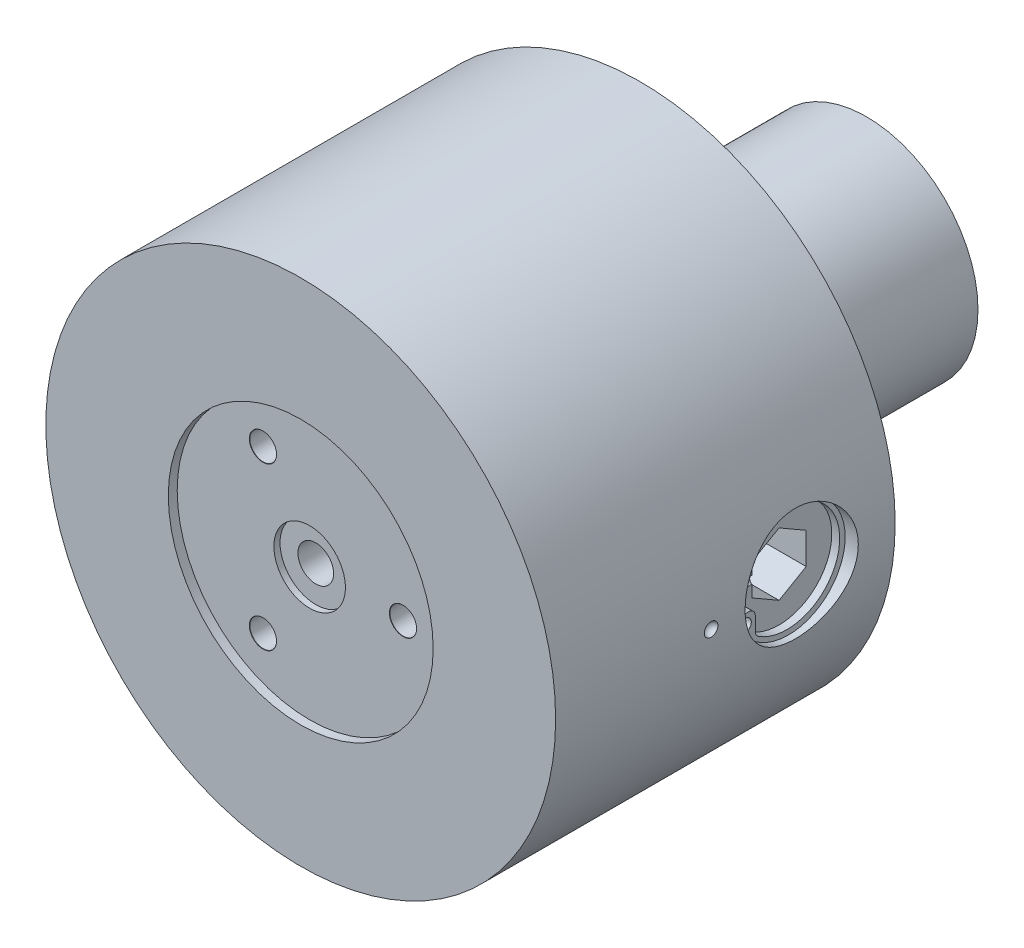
ISO-10303-21;
HEADER;
FILE_DESCRIPTION(('STEP AP214'),'2;1');
FILE_NAME('part.step','',(''),(''),'','','');
FILE_SCHEMA(('AUTOMOTIVE_DESIGN { 1 0 10303 214 1 1 1 1 }'));
ENDSEC;
DATA;
#1=APPLICATION_CONTEXT('core data for automotive mechanical design processes');
#2=APPLICATION_PROTOCOL_DEFINITION('international standard','automotive_design',2000,#1);
#3=PRODUCT_CONTEXT('',#1,'mechanical');
#4=PRODUCT('Part','Part','',(#3));
#5=PRODUCT_RELATED_PRODUCT_CATEGORY('part','',(#4));
#6=PRODUCT_DEFINITION_FORMATION('','',#4);
#7=PRODUCT_DEFINITION_CONTEXT('part definition',#1,'design');
#8=PRODUCT_DEFINITION('design','',#6,#7);
#9=PRODUCT_DEFINITION_SHAPE('','',#8);
#10=(LENGTH_UNIT() NAMED_UNIT(*) SI_UNIT(.MILLI.,.METRE.));
#11=(NAMED_UNIT(*) PLANE_ANGLE_UNIT() SI_UNIT($,.RADIAN.));
#12=(NAMED_UNIT(*) SI_UNIT($,.STERADIAN.) SOLID_ANGLE_UNIT());
#13=UNCERTAINTY_MEASURE_WITH_UNIT(LENGTH_MEASURE(1.E-05),#10,'distance_accuracy_value','');
#14=(GEOMETRIC_REPRESENTATION_CONTEXT(3) GLOBAL_UNCERTAINTY_ASSIGNED_CONTEXT((#13)) GLOBAL_UNIT_ASSIGNED_CONTEXT((#10,
#11,#12)) REPRESENTATION_CONTEXT('',''));
#15=CARTESIAN_POINT('',(0.,0.,0.));
#16=DIRECTION('',(0.,0.,1.));
#17=DIRECTION('',(1.,0.,0.));
#18=AXIS2_PLACEMENT_3D('',#15,#16,#17);
#19=CARTESIAN_POINT('',(19.967318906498,27.6098,10.4902));
#20=DIRECTION('',(1.,0.,0.));
#21=DIRECTION('',(0.,1.,0.));
#22=AXIS2_PLACEMENT_3D('',#19,#20,#21);
#23=PLANE('',#22);
#24=DIRECTION('',(0.,-1.,0.));
#25=VECTOR('',#24,1.);
#26=CARTESIAN_POINT('',(19.967318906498,1.75976362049,13.5382));
#27=LINE('',#26,#25);
#28=CARTESIAN_POINT('',(19.967318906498,1.75976362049,13.5382));
#29=VERTEX_POINT('',#28);
#30=CARTESIAN_POINT('',(19.967318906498,-1.75976362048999,13.5382));
#31=VERTEX_POINT('',#30);
#32=EDGE_CURVE('E401',#29,#31,#27,.T.);
#33=ORIENTED_EDGE('',*,*,#32,.T.);
#34=DIRECTION('',(0.,-0.5,-0.866025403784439));
#35=VECTOR('',#34,1.);
#36=CARTESIAN_POINT('',(19.967318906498,-1.75976362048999,13.5382));
#37=LINE('',#36,#35);
#38=CARTESIAN_POINT('',(19.967318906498,-3.51952724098,10.4902));
#39=VERTEX_POINT('',#38);
#40=EDGE_CURVE('E147',#31,#39,#37,.T.);
#41=ORIENTED_EDGE('',*,*,#40,.T.);
#42=DIRECTION('',(0.,0.5,-0.866025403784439));
#43=VECTOR('',#42,1.);
#44=CARTESIAN_POINT('',(19.967318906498,-3.51952724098,10.4902));
#45=LINE('',#44,#43);
#46=CARTESIAN_POINT('',(19.967318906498,-1.75976362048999,7.4422));
#47=VERTEX_POINT('',#46);
#48=EDGE_CURVE('E406',#39,#47,#45,.T.);
#49=ORIENTED_EDGE('',*,*,#48,.T.);
#50=DIRECTION('',(0.,1.,0.));
#51=VECTOR('',#50,1.);
#52=CARTESIAN_POINT('',(19.967318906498,-1.75976362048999,7.4422));
#53=LINE('',#52,#51);
#54=CARTESIAN_POINT('',(19.967318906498,1.75976362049,7.4422));
#55=VERTEX_POINT('',#54);
#56=EDGE_CURVE('E385',#47,#55,#53,.T.);
#57=ORIENTED_EDGE('',*,*,#56,.T.);
#58=DIRECTION('',(0.,0.5,0.866025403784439));
#59=VECTOR('',#58,1.);
#60=CARTESIAN_POINT('',(19.967318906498,1.75976362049,7.4422));
#61=LINE('',#60,#59);
#62=CARTESIAN_POINT('',(19.967318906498,3.51952724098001,10.4902));
#63=VERTEX_POINT('',#62);
#64=EDGE_CURVE('E392',#55,#63,#61,.T.);
#65=ORIENTED_EDGE('',*,*,#64,.T.);
#66=DIRECTION('',(0.,-0.5,0.866025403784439));
#67=VECTOR('',#66,1.);
#68=CARTESIAN_POINT('',(19.967318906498,3.51952724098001,10.4902));
#69=LINE('',#68,#67);
#70=EDGE_CURVE('E397',#63,#29,#69,.T.);
#71=ORIENTED_EDGE('',*,*,#70,.T.);
#72=EDGE_LOOP('',(#33,#41,#49,#57,#65,#71));
#73=FACE_BOUND('',#72,.T.);
#74=ADVANCED_FACE('F14',(#73),#23,.T.);
#75=CARTESIAN_POINT('',(19.967318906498,3.51952724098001,10.4902));
#76=DIRECTION('',(0.,0.866025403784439,0.5));
#77=DIRECTION('',(0.,-0.5,0.866025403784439));
#78=AXIS2_PLACEMENT_3D('',#75,#76,#77);
#79=PLANE('',#78);
#80=DIRECTION('',(1.,0.,0.));
#81=VECTOR('',#80,1.);
#82=CARTESIAN_POINT('',(19.967318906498,1.75976362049,13.5382));
#83=LINE('',#82,#81);
#84=CARTESIAN_POINT('',(26.063318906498,1.75976362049,13.5382));
#85=VERTEX_POINT('',#84);
#86=EDGE_CURVE('E394',#29,#85,#83,.T.);
#87=ORIENTED_EDGE('',*,*,#86,.F.);
#88=ORIENTED_EDGE('',*,*,#70,.F.);
#89=DIRECTION('',(1.,0.,0.));
#90=VECTOR('',#89,1.);
#91=CARTESIAN_POINT('',(19.967318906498,3.51952724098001,10.4902));
#92=LINE('',#91,#90);
#93=CARTESIAN_POINT('',(26.063318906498,3.51952724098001,10.4902));
#94=VERTEX_POINT('',#93);
#95=EDGE_CURVE('E390',#63,#94,#92,.T.);
#96=ORIENTED_EDGE('',*,*,#95,.T.);
#97=DIRECTION('',(0.,0.5,-0.866025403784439));
#98=VECTOR('',#97,1.);
#99=CARTESIAN_POINT('',(26.063318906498,1.75976362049,13.5382));
#100=LINE('',#99,#98);
#101=EDGE_CURVE('E370',#85,#94,#100,.T.);
#102=ORIENTED_EDGE('',*,*,#101,.F.);
#103=EDGE_LOOP('',(#87,#88,#96,#102));
#104=FACE_BOUND('',#103,.T.);
#105=ADVANCED_FACE('F555',(#104),#79,.F.);
#106=CARTESIAN_POINT('',(19.967318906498,1.75976362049,13.5382));
#107=DIRECTION('',(0.,0.,1.));
#108=DIRECTION('',(0.,-1.,0.));
#109=AXIS2_PLACEMENT_3D('',#106,#107,#108);
#110=PLANE('',#109);
#111=DIRECTION('',(0.,1.,0.));
#112=VECTOR('',#111,1.);
#113=CARTESIAN_POINT('',(26.063318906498,0.,13.5382));
#114=LINE('',#113,#112);
#115=CARTESIAN_POINT('',(26.063318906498,0.430678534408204,13.5382));
#116=VERTEX_POINT('',#115);
#117=EDGE_CURVE('E376',#116,#85,#114,.T.);
#118=ORIENTED_EDGE('',*,*,#117,.F.);
#119=CARTESIAN_POINT('',(26.317318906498,0.,13.5382));
#120=DIRECTION('',(0.,0.,-1.));
#121=DIRECTION('',(0.,1.,0.));
#122=AXIS2_PLACEMENT_3D('',#119,#120,#121);
#123=CIRCLE('',#122,0.5);
#124=CARTESIAN_POINT('',(26.063318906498,-0.4306785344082,13.5382));
#125=VERTEX_POINT('',#124);
#126=EDGE_CURVE('E418',#125,#116,#123,.T.);
#127=ORIENTED_EDGE('',*,*,#126,.F.);
#128=CARTESIAN_POINT('',(26.063318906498,-1.75976362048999,13.5382));
#129=VERTEX_POINT('',#128);
#130=EDGE_CURVE('E373',#129,#125,#114,.T.);
#131=ORIENTED_EDGE('',*,*,#130,.F.);
#132=DIRECTION('',(1.,0.,0.));
#133=VECTOR('',#132,1.);
#134=CARTESIAN_POINT('',(19.967318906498,-1.75976362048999,13.5382));
#135=LINE('',#134,#133);
#136=EDGE_CURVE('E399',#31,#129,#135,.T.);
#137=ORIENTED_EDGE('',*,*,#136,.F.);
#138=ORIENTED_EDGE('',*,*,#32,.F.);
#139=ORIENTED_EDGE('',*,*,#86,.T.);
#140=EDGE_LOOP('',(#118,#127,#131,#137,#138,#139));
#141=FACE_BOUND('',#140,.T.);
#142=ADVANCED_FACE('F558',(#141),#110,.F.);
#143=CARTESIAN_POINT('',(19.967318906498,-1.75976362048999,13.5382));
#144=DIRECTION('',(0.,-0.866025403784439,0.5));
#145=DIRECTION('',(0.,-0.5,-0.866025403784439));
#146=AXIS2_PLACEMENT_3D('',#143,#144,#145);
#147=PLANE('',#146);
#148=DIRECTION('',(1.,0.,0.));
#149=VECTOR('',#148,1.);
#150=CARTESIAN_POINT('',(19.967318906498,-3.51952724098,10.4902));
#151=LINE('',#150,#149);
#152=CARTESIAN_POINT('',(26.063318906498,-3.51952724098,10.4902));
#153=VERTEX_POINT('',#152);
#154=EDGE_CURVE('E403',#39,#153,#151,.T.);
#155=ORIENTED_EDGE('',*,*,#154,.F.);
#156=ORIENTED_EDGE('',*,*,#40,.F.);
#157=ORIENTED_EDGE('',*,*,#136,.T.);
#158=DIRECTION('',(0.,0.5,0.866025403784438));
#159=VECTOR('',#158,1.);
#160=CARTESIAN_POINT('',(26.063318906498,-3.51952724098,10.4902));
#161=LINE('',#160,#159);
#162=EDGE_CURVE('E377',#153,#129,#161,.T.);
#163=ORIENTED_EDGE('',*,*,#162,.F.);
#164=EDGE_LOOP('',(#155,#156,#157,#163));
#165=FACE_BOUND('',#164,.T.);
#166=ADVANCED_FACE('F562',(#165),#147,.F.);
#167=CARTESIAN_POINT('',(19.967318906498,-3.51952724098,10.4902));
#168=DIRECTION('',(0.,-0.866025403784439,-0.5));
#169=DIRECTION('',(0.,0.5,-0.866025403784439));
#170=AXIS2_PLACEMENT_3D('',#167,#168,#169);
#171=PLANE('',#170);
#172=DIRECTION('',(1.,0.,0.));
#173=VECTOR('',#172,1.);
#174=CARTESIAN_POINT('',(19.967318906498,-1.75976362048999,7.4422));
#175=LINE('',#174,#173);
#176=CARTESIAN_POINT('',(26.063318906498,-1.75976362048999,7.4422));
#177=VERTEX_POINT('',#176);
#178=EDGE_CURVE('E387',#177,#47,#175,.F.);
#179=ORIENTED_EDGE('',*,*,#178,.T.);
#180=ORIENTED_EDGE('',*,*,#48,.F.);
#181=ORIENTED_EDGE('',*,*,#154,.T.);
#182=DIRECTION('',(0.,-0.5,0.866025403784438));
#183=VECTOR('',#182,1.);
#184=CARTESIAN_POINT('',(26.063318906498,-1.75976362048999,7.4422));
#185=LINE('',#184,#183);
#186=EDGE_CURVE('E380',#177,#153,#185,.T.);
#187=ORIENTED_EDGE('',*,*,#186,.F.);
#188=EDGE_LOOP('',(#179,#180,#181,#187));
#189=FACE_BOUND('',#188,.T.);
#190=ADVANCED_FACE('F550',(#189),#171,.F.);
#191=CARTESIAN_POINT('',(19.967318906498,-1.75976362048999,7.4422));
#192=DIRECTION('',(0.,0.,-1.));
#193=DIRECTION('',(0.,1.,0.));
#194=AXIS2_PLACEMENT_3D('',#191,#192,#193);
#195=PLANE('',#194);
#196=DIRECTION('',(1.,0.,0.));
#197=VECTOR('',#196,1.);
#198=CARTESIAN_POINT('',(19.967318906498,1.75976362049,7.4422));
#199=LINE('',#198,#197);
#200=CARTESIAN_POINT('',(26.063318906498,1.75976362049,7.4422));
#201=VERTEX_POINT('',#200);
#202=EDGE_CURVE('E383',#55,#201,#199,.T.);
#203=ORIENTED_EDGE('',*,*,#202,.F.);
#204=ORIENTED_EDGE('',*,*,#56,.F.);
#205=ORIENTED_EDGE('',*,*,#178,.F.);
#206=DIRECTION('',(0.,1.,0.));
#207=VECTOR('',#206,1.);
#208=CARTESIAN_POINT('',(26.063318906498,0.,7.4422));
#209=LINE('',#208,#207);
#210=EDGE_CURVE('E364',#201,#177,#209,.F.);
#211=ORIENTED_EDGE('',*,*,#210,.F.);
#212=EDGE_LOOP('',(#203,#204,#205,#211));
#213=FACE_BOUND('',#212,.T.);
#214=ADVANCED_FACE('F547',(#213),#195,.F.);
#215=CARTESIAN_POINT('',(19.967318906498,1.75976362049,7.4422));
#216=DIRECTION('',(0.,0.866025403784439,-0.5));
#217=DIRECTION('',(0.,0.5,0.866025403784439));
#218=AXIS2_PLACEMENT_3D('',#215,#216,#217);
#219=PLANE('',#218);
#220=ORIENTED_EDGE('',*,*,#95,.F.);
#221=ORIENTED_EDGE('',*,*,#64,.F.);
#222=ORIENTED_EDGE('',*,*,#202,.T.);
#223=DIRECTION('',(0.,-0.5,-0.866025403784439));
#224=VECTOR('',#223,1.);
#225=CARTESIAN_POINT('',(26.063318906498,3.51952724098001,10.4902));
#226=LINE('',#225,#224);
#227=EDGE_CURVE('E367',#94,#201,#226,.T.);
#228=ORIENTED_EDGE('',*,*,#227,.F.);
#229=EDGE_LOOP('',(#220,#221,#222,#228));
#230=FACE_BOUND('',#229,.T.);
#231=ADVANCED_FACE('F523',(#230),#219,.F.);
#232=CARTESIAN_POINT('',(26.063318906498,-2.794,14.8082));
#233=DIRECTION('',(1.,0.,0.));
#234=DIRECTION('',(0.,1.,0.));
#235=AXIS2_PLACEMENT_3D('',#232,#233,#234);
#236=CYLINDRICAL_SURFACE('',#235,0.762);
#237=CARTESIAN_POINT('',(26.063318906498,-2.794,14.8082));
#238=DIRECTION('',(1.,0.,0.));
#239=DIRECTION('',(0.,1.,0.));
#240=AXIS2_PLACEMENT_3D('',#237,#238,#239);
#241=CIRCLE('',#240,0.762);
#242=CARTESIAN_POINT('',(26.063318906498,-2.794,14.0462));
#243=VERTEX_POINT('',#242);
#244=CARTESIAN_POINT('',(26.063318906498,-2.032,14.8082));
#245=VERTEX_POINT('',#244);
#246=EDGE_CURVE('E317',#243,#245,#241,.T.);
#247=ORIENTED_EDGE('',*,*,#246,.T.);
#248=DIRECTION('',(1.,0.,0.));
#249=VECTOR('',#248,1.);
#250=CARTESIAN_POINT('',(26.063318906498,-2.032,14.8082));
#251=LINE('',#250,#249);
#252=CARTESIAN_POINT('',(26.952318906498,-2.032,14.8082));
#253=VERTEX_POINT('',#252);
#254=EDGE_CURVE('E315',#245,#253,#251,.T.);
#255=ORIENTED_EDGE('',*,*,#254,.T.);
#256=CARTESIAN_POINT('',(26.952318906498,-2.794,14.8082));
#257=DIRECTION('',(1.,0.,0.));
#258=DIRECTION('',(0.,1.,0.));
#259=AXIS2_PLACEMENT_3D('',#256,#257,#258);
#260=CIRCLE('',#259,0.762);
#261=CARTESIAN_POINT('',(26.952318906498,-2.794,14.0462));
#262=VERTEX_POINT('',#261);
#263=EDGE_CURVE('E280',#253,#262,#260,.F.);
#264=ORIENTED_EDGE('',*,*,#263,.T.);
#265=DIRECTION('',(1.,0.,0.));
#266=VECTOR('',#265,1.);
#267=CARTESIAN_POINT('',(26.063318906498,-2.794,14.0462));
#268=LINE('',#267,#266);
#269=EDGE_CURVE('E311',#262,#243,#268,.F.);
#270=ORIENTED_EDGE('',*,*,#269,.T.);
#271=EDGE_LOOP('',(#247,#255,#264,#270));
#272=FACE_BOUND('',#271,.T.);
#273=ADVANCED_FACE('F519',(#272),#236,.T.);
#274=CARTESIAN_POINT('',(26.063318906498,-4.33358540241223,14.0462));
#275=DIRECTION('',(0.,0.,1.));
#276=DIRECTION('',(0.,-1.,0.));
#277=AXIS2_PLACEMENT_3D('',#274,#275,#276);
#278=PLANE('',#277);
#279=DIRECTION('',(1.,0.,0.));
#280=VECTOR('',#279,1.);
#281=CARTESIAN_POINT('',(26.063318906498,-4.33358540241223,14.0462));
#282=LINE('',#281,#280);
#283=CARTESIAN_POINT('',(26.952318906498,-4.33358540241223,14.0462));
#284=VERTEX_POINT('',#283);
#285=CARTESIAN_POINT('',(26.063318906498,-4.33358540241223,14.0462));
#286=VERTEX_POINT('',#285);
#287=EDGE_CURVE('E329',#284,#286,#282,.F.);
#288=ORIENTED_EDGE('',*,*,#287,.T.);
#289=DIRECTION('',(0.,-1.,0.));
#290=VECTOR('',#289,1.);
#291=CARTESIAN_POINT('',(26.063318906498,-4.33358540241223,14.0462));
#292=LINE('',#291,#290);
#293=EDGE_CURVE('E314',#243,#286,#292,.T.);
#294=ORIENTED_EDGE('',*,*,#293,.F.);
#295=ORIENTED_EDGE('',*,*,#269,.F.);
#296=DIRECTION('',(0.,-1.,0.));
#297=VECTOR('',#296,1.);
#298=CARTESIAN_POINT('',(26.952318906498,6.858,14.0462));
#299=LINE('',#298,#297);
#300=EDGE_CURVE('E276',#262,#284,#299,.T.);
#301=ORIENTED_EDGE('',*,*,#300,.T.);
#302=EDGE_LOOP('',(#288,#294,#295,#301));
#303=FACE_BOUND('',#302,.T.);
#304=ADVANCED_FACE('F515',(#303),#278,.F.);
#305=CARTESIAN_POINT('',(26.063318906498,-4.33358540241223,13.2841999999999));
#306=DIRECTION('',(1.,0.,0.));
#307=DIRECTION('',(0.,0.,1.));
#308=AXIS2_PLACEMENT_3D('',#305,#306,#307);
#309=CYLINDRICAL_SURFACE('',#308,0.762000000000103);
#310=DIRECTION('',(1.,0.,0.));
#311=VECTOR('',#310,1.);
#312=CARTESIAN_POINT('',(26.063318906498,-4.97401674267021,13.6971064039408));
#313=LINE('',#312,#311);
#314=CARTESIAN_POINT('',(26.952318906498,-4.97401674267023,13.6971064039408));
#315=VERTEX_POINT('',#314);
#316=CARTESIAN_POINT('',(26.063318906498,-4.97401674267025,13.6971064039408));
#317=VERTEX_POINT('',#316);
#318=EDGE_CURVE('E307',#315,#317,#313,.F.);
#319=ORIENTED_EDGE('',*,*,#318,.T.);
#320=CARTESIAN_POINT('',(26.063318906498,-4.33358540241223,13.2841999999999));
#321=DIRECTION('',(1.,0.,0.));
#322=DIRECTION('',(0.,0.,1.));
#323=AXIS2_PLACEMENT_3D('',#320,#321,#322);
#324=CIRCLE('',#323,0.762000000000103);
#325=EDGE_CURVE('E310',#286,#317,#324,.T.);
#326=ORIENTED_EDGE('',*,*,#325,.F.);
#327=ORIENTED_EDGE('',*,*,#287,.F.);
#328=CARTESIAN_POINT('',(26.952318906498,-4.33358540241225,13.2841999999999));
#329=DIRECTION('',(1.,0.,0.));
#330=DIRECTION('',(0.,0.,1.));
#331=AXIS2_PLACEMENT_3D('',#328,#329,#330);
#332=CIRCLE('',#331,0.762000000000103);
#333=EDGE_CURVE('E279',#284,#315,#332,.T.);
#334=ORIENTED_EDGE('',*,*,#333,.T.);
#335=EDGE_LOOP('',(#319,#326,#327,#334));
#336=FACE_BOUND('',#335,.T.);
#337=ADVANCED_FACE('F511',(#336),#309,.F.);
#338=CARTESIAN_POINT('',(26.063318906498,0.,10.4902));
#339=DIRECTION('',(1.,0.,0.));
#340=DIRECTION('',(0.,1.,0.));
#341=AXIS2_PLACEMENT_3D('',#338,#339,#340);
#342=CYLINDRICAL_SURFACE('',#341,5.9182);
#343=CARTESIAN_POINT('',(26.063318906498,0.,10.4902));
#344=DIRECTION('',(1.,0.,0.));
#345=DIRECTION('',(0.,1.,0.));
#346=AXIS2_PLACEMENT_3D('',#343,#344,#345);
#347=CIRCLE('',#346,5.9182);
#348=CARTESIAN_POINT('',(26.063318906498,4.97401674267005,13.6971064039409));
#349=VERTEX_POINT('',#348);
#350=EDGE_CURVE('E306',#317,#349,#347,.T.);
#351=ORIENTED_EDGE('',*,*,#350,.F.);
#352=ORIENTED_EDGE('',*,*,#318,.F.);
#353=CARTESIAN_POINT('',(26.952318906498,0.,10.4902));
#354=DIRECTION('',(1.,0.,0.));
#355=DIRECTION('',(0.,1.,0.));
#356=AXIS2_PLACEMENT_3D('',#353,#354,#355);
#357=CIRCLE('',#356,5.9182);
#358=CARTESIAN_POINT('',(26.952318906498,4.97401674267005,13.6971064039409));
#359=VERTEX_POINT('',#358);
#360=EDGE_CURVE('E337',#315,#359,#357,.T.);
#361=ORIENTED_EDGE('',*,*,#360,.T.);
#362=DIRECTION('',(1.,0.,0.));
#363=VECTOR('',#362,1.);
#364=CARTESIAN_POINT('',(26.063318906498,4.97401674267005,13.6971064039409));
#365=LINE('',#364,#363);
#366=EDGE_CURVE('E303',#359,#349,#365,.F.);
#367=ORIENTED_EDGE('',*,*,#366,.T.);
#368=EDGE_LOOP('',(#351,#352,#361,#367));
#369=FACE_BOUND('',#368,.T.);
#370=ADVANCED_FACE('F507',(#369),#342,.F.);
#371=CARTESIAN_POINT('',(26.063318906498,4.33358540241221,13.2842000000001));
#372=DIRECTION('',(1.,0.,0.));
#373=DIRECTION('',(0.,0.,1.));
#374=AXIS2_PLACEMENT_3D('',#371,#372,#373);
#375=CYLINDRICAL_SURFACE('',#374,0.761999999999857);
#376=DIRECTION('',(1.,0.,0.));
#377=VECTOR('',#376,1.);
#378=CARTESIAN_POINT('',(26.063318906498,4.33358540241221,14.0462));
#379=LINE('',#378,#377);
#380=CARTESIAN_POINT('',(26.952318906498,4.33358540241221,14.0462));
#381=VERTEX_POINT('',#380);
#382=CARTESIAN_POINT('',(26.063318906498,4.33358540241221,14.0462));
#383=VERTEX_POINT('',#382);
#384=EDGE_CURVE('E298',#381,#383,#379,.F.);
#385=ORIENTED_EDGE('',*,*,#384,.T.);
#386=CARTESIAN_POINT('',(26.063318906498,4.33358540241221,13.2842000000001));
#387=DIRECTION('',(1.,0.,0.));
#388=DIRECTION('',(0.,0.,1.));
#389=AXIS2_PLACEMENT_3D('',#386,#387,#388);
#390=CIRCLE('',#389,0.761999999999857);
#391=EDGE_CURVE('E302',#349,#383,#390,.T.);
#392=ORIENTED_EDGE('',*,*,#391,.F.);
#393=ORIENTED_EDGE('',*,*,#366,.F.);
#394=CARTESIAN_POINT('',(26.952318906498,4.33358540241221,13.2842000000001));
#395=DIRECTION('',(1.,0.,0.));
#396=DIRECTION('',(0.,0.,1.));
#397=AXIS2_PLACEMENT_3D('',#394,#395,#396);
#398=CIRCLE('',#397,0.761999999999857);
#399=EDGE_CURVE('E275',#359,#381,#398,.T.);
#400=ORIENTED_EDGE('',*,*,#399,.T.);
#401=EDGE_LOOP('',(#385,#392,#393,#400));
#402=FACE_BOUND('',#401,.T.);
#403=ADVANCED_FACE('F503',(#402),#375,.F.);
#404=CARTESIAN_POINT('',(26.063318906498,2.794,14.0462));
#405=DIRECTION('',(0.,0.,1.));
#406=DIRECTION('',(0.,-1.,0.));
#407=AXIS2_PLACEMENT_3D('',#404,#405,#406);
#408=PLANE('',#407);
#409=DIRECTION('',(1.,0.,0.));
#410=VECTOR('',#409,1.);
#411=CARTESIAN_POINT('',(26.063318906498,2.794,14.0462));
#412=LINE('',#411,#410);
#413=CARTESIAN_POINT('',(26.063318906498,2.794,14.0462));
#414=VERTEX_POINT('',#413);
#415=CARTESIAN_POINT('',(26.952318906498,2.794,14.0462));
#416=VERTEX_POINT('',#415);
#417=EDGE_CURVE('E295',#414,#416,#412,.T.);
#418=ORIENTED_EDGE('',*,*,#417,.F.);
#419=DIRECTION('',(0.,-1.,0.));
#420=VECTOR('',#419,1.);
#421=CARTESIAN_POINT('',(26.063318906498,2.794,14.0462));
#422=LINE('',#421,#420);
#423=EDGE_CURVE('E301',#383,#414,#422,.T.);
#424=ORIENTED_EDGE('',*,*,#423,.F.);
#425=ORIENTED_EDGE('',*,*,#384,.F.);
#426=DIRECTION('',(0.,-1.,0.));
#427=VECTOR('',#426,1.);
#428=CARTESIAN_POINT('',(26.952318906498,6.858,14.0462));
#429=LINE('',#428,#427);
#430=EDGE_CURVE('E272',#381,#416,#429,.T.);
#431=ORIENTED_EDGE('',*,*,#430,.T.);
#432=EDGE_LOOP('',(#418,#424,#425,#431));
#433=FACE_BOUND('',#432,.T.);
#434=ADVANCED_FACE('F499',(#433),#408,.F.);
#435=CARTESIAN_POINT('',(26.063318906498,2.794,14.8082));
#436=DIRECTION('',(1.,0.,0.));
#437=DIRECTION('',(0.,0.,1.));
#438=AXIS2_PLACEMENT_3D('',#435,#436,#437);
#439=CYLINDRICAL_SURFACE('',#438,0.762);
#440=CARTESIAN_POINT('',(26.063318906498,2.794,14.8082));
#441=DIRECTION('',(1.,0.,0.));
#442=DIRECTION('',(0.,0.,1.));
#443=AXIS2_PLACEMENT_3D('',#440,#441,#442);
#444=CIRCLE('',#443,0.762);
#445=CARTESIAN_POINT('',(26.063318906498,2.032,14.8082));
#446=VERTEX_POINT('',#445);
#447=EDGE_CURVE('E297',#446,#414,#444,.T.);
#448=ORIENTED_EDGE('',*,*,#447,.T.);
#449=ORIENTED_EDGE('',*,*,#417,.T.);
#450=CARTESIAN_POINT('',(26.952318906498,2.794,14.8082));
#451=DIRECTION('',(1.,0.,0.));
#452=DIRECTION('',(0.,0.,1.));
#453=AXIS2_PLACEMENT_3D('',#450,#451,#452);
#454=CIRCLE('',#453,0.762);
#455=CARTESIAN_POINT('',(26.952318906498,2.032,14.8082));
#456=VERTEX_POINT('',#455);
#457=EDGE_CURVE('E271',#416,#456,#454,.F.);
#458=ORIENTED_EDGE('',*,*,#457,.T.);
#459=DIRECTION('',(-1.,0.,0.));
#460=VECTOR('',#459,1.);
#461=CARTESIAN_POINT('',(26.063318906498,2.032,14.8082));
#462=LINE('',#461,#460);
#463=EDGE_CURVE('E292',#456,#446,#462,.T.);
#464=ORIENTED_EDGE('',*,*,#463,.T.);
#465=EDGE_LOOP('',(#448,#449,#458,#464));
#466=FACE_BOUND('',#465,.T.);
#467=ADVANCED_FACE('F495',(#466),#439,.T.);
#468=CARTESIAN_POINT('',(26.063318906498,-2.032,14.8082));
#469=DIRECTION('',(0.,-1.,0.));
#470=DIRECTION('',(1.,0.,0.));
#471=AXIS2_PLACEMENT_3D('',#468,#469,#470);
#472=PLANE('',#471);
#473=ORIENTED_EDGE('',*,*,#254,.F.);
#474=DIRECTION('',(0.,0.,1.));
#475=VECTOR('',#474,1.);
#476=CARTESIAN_POINT('',(26.063318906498,-2.032,14.8082));
#477=LINE('',#476,#475);
#478=CARTESIAN_POINT('',(26.063318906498,-2.032,15.9082051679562));
#479=VERTEX_POINT('',#478);
#480=EDGE_CURVE('E320',#479,#245,#477,.F.);
#481=ORIENTED_EDGE('',*,*,#480,.F.);
#482=DIRECTION('',(1.,0.,0.));
#483=VECTOR('',#482,1.);
#484=CARTESIAN_POINT('',(26.063318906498,-2.032,15.9082051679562));
#485=LINE('',#484,#483);
#486=CARTESIAN_POINT('',(26.952318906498,-2.03200000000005,15.9082051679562));
#487=VERTEX_POINT('',#486);
#488=EDGE_CURVE('E318',#487,#479,#485,.F.);
#489=ORIENTED_EDGE('',*,*,#488,.F.);
#490=DIRECTION('',(0.,0.,1.));
#491=VECTOR('',#490,1.);
#492=CARTESIAN_POINT('',(26.952318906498,-2.03200000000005,16.7816053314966));
#493=LINE('',#492,#491);
#494=EDGE_CURVE('E281',#487,#253,#493,.F.);
#495=ORIENTED_EDGE('',*,*,#494,.T.);
#496=EDGE_LOOP('',(#473,#481,#489,#495));
#497=FACE_BOUND('',#496,.T.);
#498=ADVANCED_FACE('F498',(#497),#472,.F.);
#499=CARTESIAN_POINT('',(26.063318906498,-2.79400000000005,15.9082051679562));
#500=DIRECTION('',(1.,0.,0.));
#501=DIRECTION('',(0.,1.,0.));
#502=AXIS2_PLACEMENT_3D('',#499,#500,#501);
#503=CYLINDRICAL_SURFACE('',#502,0.762);
#504=ORIENTED_EDGE('',*,*,#488,.T.);
#505=CARTESIAN_POINT('',(26.063318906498,-2.79400000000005,15.9082051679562));
#506=DIRECTION('',(1.,0.,0.));
#507=DIRECTION('',(0.,1.,0.));
#508=AXIS2_PLACEMENT_3D('',#505,#506,#507);
#509=CIRCLE('',#508,0.762);
#510=CARTESIAN_POINT('',(26.063318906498,-3.14325000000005,16.5854558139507));
#511=VERTEX_POINT('',#510);
#512=EDGE_CURVE('E37',#479,#511,#509,.T.);
#513=ORIENTED_EDGE('',*,*,#512,.T.);
#514=DIRECTION('',(1.,0.,0.));
#515=VECTOR('',#514,1.);
#516=CARTESIAN_POINT('',(26.063318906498,-3.14325000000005,16.5854558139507));
#517=LINE('',#516,#515);
#518=CARTESIAN_POINT('',(26.952318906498,-3.14325000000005,16.5854558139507));
#519=VERTEX_POINT('',#518);
#520=EDGE_CURVE('E321',#511,#519,#517,.T.);
#521=ORIENTED_EDGE('',*,*,#520,.T.);
#522=CARTESIAN_POINT('',(26.952318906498,-2.79400000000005,15.9082051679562));
#523=DIRECTION('',(1.,0.,0.));
#524=DIRECTION('',(0.,1.,0.));
#525=AXIS2_PLACEMENT_3D('',#522,#523,#524);
#526=CIRCLE('',#525,0.762);
#527=EDGE_CURVE('E284',#519,#487,#526,.F.);
#528=ORIENTED_EDGE('',*,*,#527,.T.);
#529=EDGE_LOOP('',(#504,#513,#521,#528));
#530=FACE_BOUND('',#529,.T.);
#531=ADVANCED_FACE('F493',(#530),#503,.T.);
#532=CARTESIAN_POINT('',(26.063318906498,2.032,15.9082051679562));
#533=DIRECTION('',(0.,1.,0.));
#534=DIRECTION('',(-1.,0.,0.));
#535=AXIS2_PLACEMENT_3D('',#532,#533,#534);
#536=PLANE('',#535);
#537=DIRECTION('',(1.,0.,0.));
#538=VECTOR('',#537,1.);
#539=CARTESIAN_POINT('',(26.063318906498,2.032,15.9082051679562));
#540=LINE('',#539,#538);
#541=CARTESIAN_POINT('',(26.063318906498,2.032,15.9082051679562));
#542=VERTEX_POINT('',#541);
#543=CARTESIAN_POINT('',(26.952318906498,2.032,15.9082051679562));
#544=VERTEX_POINT('',#543);
#545=EDGE_CURVE('E289',#542,#544,#540,.T.);
#546=ORIENTED_EDGE('',*,*,#545,.F.);
#547=DIRECTION('',(0.,0.,1.));
#548=VECTOR('',#547,1.);
#549=CARTESIAN_POINT('',(26.063318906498,2.032,15.9082051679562));
#550=LINE('',#549,#548);
#551=EDGE_CURVE('E291',#446,#542,#550,.T.);
#552=ORIENTED_EDGE('',*,*,#551,.F.);
#553=ORIENTED_EDGE('',*,*,#463,.F.);
#554=DIRECTION('',(0.,0.,1.));
#555=VECTOR('',#554,1.);
#556=CARTESIAN_POINT('',(26.952318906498,2.032,16.7816053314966));
#557=LINE('',#556,#555);
#558=EDGE_CURVE('E267',#456,#544,#557,.T.);
#559=ORIENTED_EDGE('',*,*,#558,.T.);
#560=EDGE_LOOP('',(#546,#552,#553,#559));
#561=FACE_BOUND('',#560,.T.);
#562=ADVANCED_FACE('F483',(#561),#536,.F.);
#563=CARTESIAN_POINT('',(26.063318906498,0.,10.4902));
#564=DIRECTION('',(1.,0.,0.));
#565=DIRECTION('',(0.,1.,0.));
#566=AXIS2_PLACEMENT_3D('',#563,#564,#565);
#567=CYLINDRICAL_SURFACE('',#566,6.858);
#568=DIRECTION('',(1.,0.,0.));
#569=VECTOR('',#568,1.);
#570=CARTESIAN_POINT('',(26.063318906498,3.14325,16.5854558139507));
#571=LINE('',#570,#569);
#572=CARTESIAN_POINT('',(26.063318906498,3.14325,16.5854558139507));
#573=VERTEX_POINT('',#572);
#574=CARTESIAN_POINT('',(26.952318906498,3.14325,16.5854558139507));
#575=VERTEX_POINT('',#574);
#576=EDGE_CURVE('E285',#573,#575,#571,.T.);
#577=ORIENTED_EDGE('',*,*,#576,.T.);
#578=CARTESIAN_POINT('',(26.952318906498,0.,10.4902));
#579=DIRECTION('',(1.,0.,0.));
#580=DIRECTION('',(0.,1.,0.));
#581=AXIS2_PLACEMENT_3D('',#578,#579,#580);
#582=CIRCLE('',#581,6.858);
#583=EDGE_CURVE('E345',#575,#519,#582,.F.);
#584=ORIENTED_EDGE('',*,*,#583,.T.);
#585=ORIENTED_EDGE('',*,*,#520,.F.);
#586=CARTESIAN_POINT('',(26.063318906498,0.,10.4902));
#587=DIRECTION('',(-1.,0.,0.));
#588=DIRECTION('',(0.,0.,-1.));
#589=AXIS2_PLACEMENT_3D('',#586,#587,#588);
#590=CIRCLE('',#589,6.858);
#591=EDGE_CURVE('E262',#573,#511,#590,.T.);
#592=ORIENTED_EDGE('',*,*,#591,.F.);
#593=EDGE_LOOP('',(#577,#584,#585,#592));
#594=FACE_BOUND('',#593,.T.);
#595=ADVANCED_FACE('F479',(#594),#567,.T.);
#596=CARTESIAN_POINT('',(26.952318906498,6.858,16.7816053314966));
#597=DIRECTION('',(-1.,0.,0.));
#598=DIRECTION('',(0.,-1.,0.));
#599=AXIS2_PLACEMENT_3D('',#596,#597,#598);
#600=PLANE('',#599);
#601=ORIENTED_EDGE('',*,*,#583,.F.);
#602=CARTESIAN_POINT('',(26.952318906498,2.794,15.9082051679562));
#603=DIRECTION('',(1.,0.,0.));
#604=DIRECTION('',(0.,0.,1.));
#605=AXIS2_PLACEMENT_3D('',#602,#603,#604);
#606=CIRCLE('',#605,0.762);
#607=EDGE_CURVE('E270',#544,#575,#606,.F.);
#608=ORIENTED_EDGE('',*,*,#607,.F.);
#609=ORIENTED_EDGE('',*,*,#558,.F.);
#610=ORIENTED_EDGE('',*,*,#457,.F.);
#611=ORIENTED_EDGE('',*,*,#430,.F.);
#612=ORIENTED_EDGE('',*,*,#399,.F.);
#613=ORIENTED_EDGE('',*,*,#360,.F.);
#614=ORIENTED_EDGE('',*,*,#333,.F.);
#615=ORIENTED_EDGE('',*,*,#300,.F.);
#616=ORIENTED_EDGE('',*,*,#263,.F.);
#617=ORIENTED_EDGE('',*,*,#494,.F.);
#618=ORIENTED_EDGE('',*,*,#527,.F.);
#619=EDGE_LOOP('',(#601,#608,#609,#610,#611,#612,#613,#614,#615,#616,#617,#618));
#620=FACE_BOUND('',#619,.T.);
#621=CARTESIAN_POINT('',(26.952318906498,-3.175,15.1892));
#622=DIRECTION('',(-1.,0.,0.));
#623=DIRECTION('',(0.,-1.,0.));
#624=AXIS2_PLACEMENT_3D('',#621,#622,#623);
#625=CIRCLE('',#624,0.6985);
#626=CARTESIAN_POINT('',(26.9523189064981,-3.8735,15.1892));
#627=VERTEX_POINT('',#626);
#628=EDGE_CURVE('E347',#627,#627,#625,.F.);
#629=ORIENTED_EDGE('',*,*,#628,.F.);
#630=EDGE_LOOP('',(#629));
#631=FACE_BOUND('',#630,.T.);
#632=CARTESIAN_POINT('',(26.952318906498,3.175,15.1892));
#633=DIRECTION('',(-1.,0.,0.));
#634=DIRECTION('',(0.,-1.,0.));
#635=AXIS2_PLACEMENT_3D('',#632,#633,#634);
#636=CIRCLE('',#635,0.6985);
#637=CARTESIAN_POINT('',(26.9523189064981,2.4765,15.1892));
#638=VERTEX_POINT('',#637);
#639=EDGE_CURVE('E288',#638,#638,#636,.F.);
#640=ORIENTED_EDGE('',*,*,#639,.F.);
#641=EDGE_LOOP('',(#640));
#642=FACE_BOUND('',#641,.T.);
#643=ADVANCED_FACE('F475',(#620,#631,#642),#600,.F.);
#644=CARTESIAN_POINT('',(26.952318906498,3.175,15.1892));
#645=DIRECTION('',(-1.,0.,0.));
#646=DIRECTION('',(0.,-1.,0.));
#647=AXIS2_PLACEMENT_3D('',#644,#645,#646);
#648=CYLINDRICAL_SURFACE('',#647,0.6985);
#649=ORIENTED_EDGE('',*,*,#639,.T.);
#650=EDGE_LOOP('',(#649));
#651=FACE_BOUND('',#650,.T.);
#652=CARTESIAN_POINT('',(26.063318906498,3.175,15.1892));
#653=DIRECTION('',(-1.,0.,0.));
#654=DIRECTION('',(0.,0.,-1.));
#655=AXIS2_PLACEMENT_3D('',#652,#653,#654);
#656=CIRCLE('',#655,0.6985);
#657=CARTESIAN_POINT('',(26.063318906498,3.175,14.4907));
#658=VERTEX_POINT('',#657);
#659=EDGE_CURVE('E254',#658,#658,#656,.T.);
#660=ORIENTED_EDGE('',*,*,#659,.T.);
#661=EDGE_LOOP('',(#660));
#662=FACE_BOUND('',#661,.T.);
#663=ADVANCED_FACE('F478',(#651,#662),#648,.F.);
#664=CARTESIAN_POINT('',(26.952318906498,-3.175,15.1892));
#665=DIRECTION('',(-1.,0.,0.));
#666=DIRECTION('',(0.,-1.,0.));
#667=AXIS2_PLACEMENT_3D('',#664,#665,#666);
#668=CYLINDRICAL_SURFACE('',#667,0.6985);
#669=CARTESIAN_POINT('',(26.063318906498,-3.175,15.1892));
#670=DIRECTION('',(-1.,0.,0.));
#671=DIRECTION('',(0.,0.,-1.));
#672=AXIS2_PLACEMENT_3D('',#669,#670,#671);
#673=CIRCLE('',#672,0.6985);
#674=CARTESIAN_POINT('',(26.063318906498,-3.175,14.4907));
#675=VERTEX_POINT('',#674);
#676=EDGE_CURVE('E257',#675,#675,#673,.T.);
#677=ORIENTED_EDGE('',*,*,#676,.T.);
#678=EDGE_LOOP('',(#677));
#679=FACE_BOUND('',#678,.T.);
#680=ORIENTED_EDGE('',*,*,#628,.T.);
#681=EDGE_LOOP('',(#680));
#682=FACE_BOUND('',#681,.T.);
#683=ADVANCED_FACE('F489',(#679,#682),#668,.F.);
#684=CARTESIAN_POINT('',(26.063318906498,2.794,15.9082051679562));
#685=DIRECTION('',(1.,0.,0.));
#686=DIRECTION('',(0.,0.,1.));
#687=AXIS2_PLACEMENT_3D('',#684,#685,#686);
#688=CYLINDRICAL_SURFACE('',#687,0.762);
#689=ORIENTED_EDGE('',*,*,#607,.T.);
#690=ORIENTED_EDGE('',*,*,#576,.F.);
#691=CARTESIAN_POINT('',(26.063318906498,2.794,15.9082051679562));
#692=DIRECTION('',(-1.,0.,0.));
#693=DIRECTION('',(0.,0.,-1.));
#694=AXIS2_PLACEMENT_3D('',#691,#692,#693);
#695=CIRCLE('',#694,0.762);
#696=EDGE_CURVE('E260',#542,#573,#695,.T.);
#697=ORIENTED_EDGE('',*,*,#696,.F.);
#698=ORIENTED_EDGE('',*,*,#545,.T.);
#699=EDGE_LOOP('',(#689,#690,#697,#698));
#700=FACE_BOUND('',#699,.T.);
#701=ADVANCED_FACE('F485',(#700),#688,.T.);
#702=CARTESIAN_POINT('',(-5.23875,-9.07378116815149,27.1));
#703=DIRECTION('',(0.,0.,1.));
#704=DIRECTION('',(-1.,0.,0.));
#705=AXIS2_PLACEMENT_3D('',#702,#703,#704);
#706=PLANE('',#705);
#707=CARTESIAN_POINT('',(-5.23875,-9.07378116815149,27.1));
#708=DIRECTION('',(0.,0.,1.));
#709=DIRECTION('',(-1.,0.,0.));
#710=AXIS2_PLACEMENT_3D('',#707,#708,#709);
#711=CIRCLE('',#710,1.5);
#712=CARTESIAN_POINT('',(-6.73875,-9.07378116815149,27.1));
#713=VERTEX_POINT('',#712);
#714=EDGE_CURVE('E253',#713,#713,#711,.T.);
#715=ORIENTED_EDGE('',*,*,#714,.T.);
#716=EDGE_LOOP('',(#715));
#717=FACE_BOUND('',#716,.T.);
#718=ADVANCED_FACE('F488',(#717),#706,.T.);
#719=CARTESIAN_POINT('',(-5.23875,9.0737811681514,27.1));
#720=DIRECTION('',(0.,0.,1.));
#721=DIRECTION('',(-1.,0.,0.));
#722=AXIS2_PLACEMENT_3D('',#719,#720,#721);
#723=PLANE('',#722);
#724=CARTESIAN_POINT('',(-5.23875,9.0737811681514,27.1));
#725=DIRECTION('',(0.,0.,1.));
#726=DIRECTION('',(-1.,0.,0.));
#727=AXIS2_PLACEMENT_3D('',#724,#725,#726);
#728=CIRCLE('',#727,1.5);
#729=CARTESIAN_POINT('',(-6.73875,9.0737811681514,27.1));
#730=VERTEX_POINT('',#729);
#731=EDGE_CURVE('E249',#730,#730,#728,.T.);
#732=ORIENTED_EDGE('',*,*,#731,.T.);
#733=EDGE_LOOP('',(#732));
#734=FACE_BOUND('',#733,.T.);
#735=ADVANCED_FACE('F763',(#734),#723,.T.);
#736=CARTESIAN_POINT('',(10.4775,0.,27.1));
#737=DIRECTION('',(0.,0.,1.));
#738=DIRECTION('',(-1.,0.,0.));
#739=AXIS2_PLACEMENT_3D('',#736,#737,#738);
#740=PLANE('',#739);
#741=CARTESIAN_POINT('',(10.4775,0.,27.1));
#742=DIRECTION('',(0.,0.,1.));
#743=DIRECTION('',(-1.,0.,0.));
#744=AXIS2_PLACEMENT_3D('',#741,#742,#743);
#745=CIRCLE('',#744,1.5);
#746=CARTESIAN_POINT('',(8.9775,0.,27.1));
#747=VERTEX_POINT('',#746);
#748=EDGE_CURVE('E245',#747,#747,#745,.T.);
#749=ORIENTED_EDGE('',*,*,#748,.T.);
#750=EDGE_LOOP('',(#749));
#751=FACE_BOUND('',#750,.T.);
#752=ADVANCED_FACE('F754',(#751),#740,.T.);
#753=CARTESIAN_POINT('',(-5.23875,-9.07378116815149,27.1));
#754=DIRECTION('',(0.,0.,1.));
#755=DIRECTION('',(-1.,0.,0.));
#756=AXIS2_PLACEMENT_3D('',#753,#754,#755);
#757=CYLINDRICAL_SURFACE('',#756,1.5);
#758=ORIENTED_EDGE('',*,*,#714,.F.);
#759=EDGE_LOOP('',(#758));
#760=FACE_BOUND('',#759,.T.);
#761=CARTESIAN_POINT('',(-5.23875,-9.07378116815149,37.0712407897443));
#762=DIRECTION('',(0.,0.,1.));
#763=DIRECTION('',(-1.,0.,0.));
#764=AXIS2_PLACEMENT_3D('',#761,#762,#763);
#765=CIRCLE('',#764,1.5);
#766=CARTESIAN_POINT('',(-6.73875,-9.07378116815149,37.0712407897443));
#767=VERTEX_POINT('',#766);
#768=EDGE_CURVE('E250',#767,#767,#765,.F.);
#769=ORIENTED_EDGE('',*,*,#768,.F.);
#770=EDGE_LOOP('',(#769));
#771=FACE_BOUND('',#770,.T.);
#772=ADVANCED_FACE('F745',(#760,#771),#757,.F.);
#773=CARTESIAN_POINT('',(-5.23875,9.0737811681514,27.1));
#774=DIRECTION('',(0.,0.,1.));
#775=DIRECTION('',(-1.,0.,0.));
#776=AXIS2_PLACEMENT_3D('',#773,#774,#775);
#777=CYLINDRICAL_SURFACE('',#776,1.5);
#778=ORIENTED_EDGE('',*,*,#731,.F.);
#779=EDGE_LOOP('',(#778));
#780=FACE_BOUND('',#779,.T.);
#781=CARTESIAN_POINT('',(-5.23875,9.0737811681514,37.0712407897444));
#782=DIRECTION('',(0.,0.,1.));
#783=DIRECTION('',(-1.,0.,0.));
#784=AXIS2_PLACEMENT_3D('',#781,#782,#783);
#785=CIRCLE('',#784,1.5);
#786=CARTESIAN_POINT('',(-6.73875,9.0737811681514,37.0712407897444));
#787=VERTEX_POINT('',#786);
#788=EDGE_CURVE('E246',#787,#787,#785,.F.);
#789=ORIENTED_EDGE('',*,*,#788,.F.);
#790=EDGE_LOOP('',(#789));
#791=FACE_BOUND('',#790,.T.);
#792=ADVANCED_FACE('F737',(#780,#791),#777,.F.);
#793=CARTESIAN_POINT('',(10.4775,0.,27.1));
#794=DIRECTION('',(0.,0.,1.));
#795=DIRECTION('',(-1.,0.,0.));
#796=AXIS2_PLACEMENT_3D('',#793,#794,#795);
#797=CYLINDRICAL_SURFACE('',#796,1.5);
#798=ORIENTED_EDGE('',*,*,#748,.F.);
#799=EDGE_LOOP('',(#798));
#800=FACE_BOUND('',#799,.T.);
#801=CARTESIAN_POINT('',(10.4775,0.,37.0712407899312));
#802=DIRECTION('',(0.,0.,1.));
#803=DIRECTION('',(-1.,0.,0.));
#804=AXIS2_PLACEMENT_3D('',#801,#802,#803);
#805=CIRCLE('',#804,1.5);
#806=CARTESIAN_POINT('',(8.9775,0.,37.0712407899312));
#807=VERTEX_POINT('',#806);
#808=EDGE_CURVE('E242',#807,#807,#805,.F.);
#809=ORIENTED_EDGE('',*,*,#808,.F.);
#810=EDGE_LOOP('',(#809));
#811=FACE_BOUND('',#810,.T.);
#812=ADVANCED_FACE('F200',(#800,#811),#797,.F.);
#813=CARTESIAN_POINT('',(0.,0.,38.1));
#814=DIRECTION('',(0.,0.,-1.));
#815=DIRECTION('',(1.,0.,0.));
#816=AXIS2_PLACEMENT_3D('',#813,#814,#815);
#817=CYLINDRICAL_SURFACE('',#816,12.4968);
#818=CARTESIAN_POINT('',(0.,0.,-25.4));
#819=DIRECTION('',(0.,0.,-1.));
#820=DIRECTION('',(1.,0.,0.));
#821=AXIS2_PLACEMENT_3D('',#818,#819,#820);
#822=CIRCLE('',#821,12.4968);
#823=CARTESIAN_POINT('',(12.4968,0.,-25.4));
#824=VERTEX_POINT('',#823);
#825=EDGE_CURVE('E236',#824,#824,#822,.F.);
#826=ORIENTED_EDGE('',*,*,#825,.T.);
#827=EDGE_LOOP('',(#826));
#828=FACE_BOUND('',#827,.T.);
#829=CARTESIAN_POINT('',(0.,0.,0.));
#830=DIRECTION('',(0.,0.,-1.));
#831=DIRECTION('',(1.,0.,0.));
#832=AXIS2_PLACEMENT_3D('',#829,#830,#831);
#833=CIRCLE('',#832,12.4968);
#834=CARTESIAN_POINT('',(12.4968,0.,0.));
#835=VERTEX_POINT('',#834);
#836=EDGE_CURVE('E165',#835,#835,#833,.F.);
#837=ORIENTED_EDGE('',*,*,#836,.F.);
#838=EDGE_LOOP('',(#837));
#839=FACE_BOUND('',#838,.T.);
#840=ADVANCED_FACE('F464',(#828,#839),#817,.T.);
#841=CARTESIAN_POINT('',(-5.23875,-9.07378116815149,37.0999999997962));
#842=DIRECTION('',(0.,0.,1.));
#843=DIRECTION('',(-1.,0.,0.));
#844=AXIS2_PLACEMENT_3D('',#841,#842,#843);
#845=CONICAL_SURFACE('',#844,1.52499999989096,0.715584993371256);
#846=ORIENTED_EDGE('',*,*,#768,.T.);
#847=EDGE_LOOP('',(#846));
#848=FACE_BOUND('',#847,.T.);
#849=CARTESIAN_POINT('',(-5.23875,-9.07378116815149,37.0999999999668));
#850=DIRECTION('',(0.,0.,1.));
#851=DIRECTION('',(-1.,0.,0.));
#852=AXIS2_PLACEMENT_3D('',#849,#850,#851);
#853=CIRCLE('',#852,1.5250000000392);
#854=CARTESIAN_POINT('',(-6.7637500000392,-9.07378116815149,37.0999999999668));
#855=VERTEX_POINT('',#854);
#856=EDGE_CURVE('E233',#855,#855,#853,.F.);
#857=ORIENTED_EDGE('',*,*,#856,.F.);
#858=EDGE_LOOP('',(#857));
#859=FACE_BOUND('',#858,.T.);
#860=ADVANCED_FACE('F460',(#848,#859),#845,.F.);
#861=CARTESIAN_POINT('',(-5.23875,9.0737811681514,37.0999999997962));
#862=DIRECTION('',(0.,0.,1.));
#863=DIRECTION('',(-1.,0.,0.));
#864=AXIS2_PLACEMENT_3D('',#861,#862,#863);
#865=CONICAL_SURFACE('',#864,1.52499999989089,0.715584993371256);
#866=ORIENTED_EDGE('',*,*,#788,.T.);
#867=EDGE_LOOP('',(#866));
#868=FACE_BOUND('',#867,.T.);
#869=CARTESIAN_POINT('',(-5.23875,9.0737811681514,37.0999999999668));
#870=DIRECTION('',(0.,0.,1.));
#871=DIRECTION('',(-1.,0.,0.));
#872=AXIS2_PLACEMENT_3D('',#869,#870,#871);
#873=CIRCLE('',#872,1.52500000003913);
#874=CARTESIAN_POINT('',(-6.76375000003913,9.0737811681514,37.0999999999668));
#875=VERTEX_POINT('',#874);
#876=EDGE_CURVE('E230',#875,#875,#873,.F.);
#877=ORIENTED_EDGE('',*,*,#876,.F.);
#878=EDGE_LOOP('',(#877));
#879=FACE_BOUND('',#878,.T.);
#880=ADVANCED_FACE('F456',(#868,#879),#865,.F.);
#881=CARTESIAN_POINT('',(10.4775,0.,37.1000000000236));
#882=DIRECTION('',(0.,0.,1.));
#883=DIRECTION('',(-1.,0.,0.));
#884=AXIS2_PLACEMENT_3D('',#881,#882,#883);
#885=CONICAL_SURFACE('',#884,1.52499999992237,0.715584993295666);
#886=ORIENTED_EDGE('',*,*,#808,.T.);
#887=EDGE_LOOP('',(#886));
#888=FACE_BOUND('',#887,.T.);
#889=CARTESIAN_POINT('',(10.4775,0.,37.1000000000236));
#890=DIRECTION('',(0.,0.,1.));
#891=DIRECTION('',(-1.,0.,0.));
#892=AXIS2_PLACEMENT_3D('',#889,#890,#891);
#893=CIRCLE('',#892,1.52499999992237);
#894=CARTESIAN_POINT('',(8.95250000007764,0.,37.1000000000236));
#895=VERTEX_POINT('',#894);
#896=EDGE_CURVE('E227',#895,#895,#893,.F.);
#897=ORIENTED_EDGE('',*,*,#896,.F.);
#898=EDGE_LOOP('',(#897));
#899=FACE_BOUND('',#898,.T.);
#900=ADVANCED_FACE('F453',(#888,#899),#885,.F.);
#901=CARTESIAN_POINT('',(0.,0.,37.1));
#902=DIRECTION('',(0.,0.,1.));
#903=DIRECTION('',(-1.,0.,0.));
#904=AXIS2_PLACEMENT_3D('',#901,#902,#903);
#905=CYLINDRICAL_SURFACE('',#904,14.86);
#906=CARTESIAN_POINT('',(0.,0.,38.1));
#907=DIRECTION('',(0.,0.,1.));
#908=DIRECTION('',(-1.,0.,0.));
#909=AXIS2_PLACEMENT_3D('',#906,#907,#908);
#910=CIRCLE('',#909,14.86);
#911=CARTESIAN_POINT('',(-14.86,0.,38.1));
#912=VERTEX_POINT('',#911);
#913=EDGE_CURVE('E212',#912,#912,#910,.F.);
#914=ORIENTED_EDGE('',*,*,#913,.F.);
#915=EDGE_LOOP('',(#914));
#916=FACE_BOUND('',#915,.T.);
#917=CARTESIAN_POINT('',(0.,0.,37.1));
#918=DIRECTION('',(0.,0.,1.));
#919=DIRECTION('',(-1.,0.,0.));
#920=AXIS2_PLACEMENT_3D('',#917,#918,#919);
#921=CIRCLE('',#920,14.86);
#922=CARTESIAN_POINT('',(-14.86,0.,37.1));
#923=VERTEX_POINT('',#922);
#924=EDGE_CURVE('E218',#923,#923,#921,.T.);
#925=ORIENTED_EDGE('',*,*,#924,.F.);
#926=EDGE_LOOP('',(#925));
#927=FACE_BOUND('',#926,.T.);
#928=ADVANCED_FACE('F438',(#916,#927),#905,.F.);
#929=CARTESIAN_POINT('',(0.,0.,37.1));
#930=DIRECTION('',(0.,0.,1.));
#931=DIRECTION('',(-1.,0.,0.));
#932=AXIS2_PLACEMENT_3D('',#929,#930,#931);
#933=PLANE('',#932);
#934=CARTESIAN_POINT('',(0.,0.,37.1));
#935=DIRECTION('',(0.,0.,1.));
#936=DIRECTION('',(-1.,0.,0.));
#937=AXIS2_PLACEMENT_3D('',#934,#935,#936);
#938=CIRCLE('',#937,4.0132);
#939=CARTESIAN_POINT('',(-4.0132,0.,37.1));
#940=VERTEX_POINT('',#939);
#941=EDGE_CURVE('E224',#940,#940,#938,.F.);
#942=ORIENTED_EDGE('',*,*,#941,.T.);
#943=EDGE_LOOP('',(#942));
#944=FACE_BOUND('',#943,.T.);
#945=ORIENTED_EDGE('',*,*,#924,.T.);
#946=EDGE_LOOP('',(#945));
#947=FACE_BOUND('',#946,.T.);
#948=ORIENTED_EDGE('',*,*,#896,.T.);
#949=EDGE_LOOP('',(#948));
#950=FACE_BOUND('',#949,.T.);
#951=ORIENTED_EDGE('',*,*,#876,.T.);
#952=EDGE_LOOP('',(#951));
#953=FACE_BOUND('',#952,.T.);
#954=ORIENTED_EDGE('',*,*,#856,.T.);
#955=EDGE_LOOP('',(#954));
#956=FACE_BOUND('',#955,.T.);
#957=ADVANCED_FACE('F440',(#944,#947,#950,#953,#956),#933,.T.);
#958=CARTESIAN_POINT('',(0.,0.,-25.4));
#959=DIRECTION('',(0.,0.,1.));
#960=DIRECTION('',(-1.,0.,0.));
#961=AXIS2_PLACEMENT_3D('',#958,#959,#960);
#962=CYLINDRICAL_SURFACE('',#961,4.0132);
#963=CARTESIAN_POINT('',(0.,0.,36.4109));
#964=DIRECTION('',(0.,0.,1.));
#965=DIRECTION('',(1.,0.,0.));
#966=AXIS2_PLACEMENT_3D('',#963,#964,#965);
#967=CIRCLE('',#966,4.0132);
#968=CARTESIAN_POINT('',(4.0132,0.,36.4109));
#969=VERTEX_POINT('',#968);
#970=EDGE_CURVE('E408',#969,#969,#967,.F.);
#971=ORIENTED_EDGE('',*,*,#970,.T.);
#972=EDGE_LOOP('',(#971));
#973=FACE_BOUND('',#972,.T.);
#974=ORIENTED_EDGE('',*,*,#941,.F.);
#975=EDGE_LOOP('',(#974));
#976=FACE_BOUND('',#975,.T.);
#977=ADVANCED_FACE('F443',(#973,#976),#962,.F.);
#978=CARTESIAN_POINT('',(12.4968,0.,0.));
#979=DIRECTION('',(0.,0.,-1.));
#980=DIRECTION('',(1.,0.,0.));
#981=AXIS2_PLACEMENT_3D('',#978,#979,#980);
#982=PLANE('',#981);
#983=ORIENTED_EDGE('',*,*,#836,.T.);
#984=EDGE_LOOP('',(#983));
#985=FACE_BOUND('',#984,.T.);
#986=CARTESIAN_POINT('',(0.,0.,0.));
#987=DIRECTION('',(0.,0.,-1.));
#988=DIRECTION('',(1.,0.,0.));
#989=AXIS2_PLACEMENT_3D('',#986,#987,#988);
#990=CIRCLE('',#989,28.603318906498);
#991=CARTESIAN_POINT('',(28.603318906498,0.,0.));
#992=VERTEX_POINT('',#991);
#993=EDGE_CURVE('E174',#992,#992,#990,.F.);
#994=ORIENTED_EDGE('',*,*,#993,.F.);
#995=EDGE_LOOP('',(#994));
#996=FACE_BOUND('',#995,.T.);
#997=ADVANCED_FACE('F202',(#985,#996),#982,.T.);
#998=CARTESIAN_POINT('',(28.603318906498,0.,20.6502));
#999=DIRECTION('',(0.,0.,1.));
#1000=DIRECTION('',(-1.,0.,0.));
#1001=AXIS2_PLACEMENT_3D('',#998,#999,#1000);
#1002=SPHERICAL_SURFACE('',#1001,0.762);
#1003=CARTESIAN_POINT('',(28.603318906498,0.,21.4122));
#1004=CARTESIAN_POINT('',(28.603318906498,-3.33333339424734E-05,21.4121999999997));
#1005=CARTESIAN_POINT('',(28.6033189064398,-6.66666670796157E-05,21.4121999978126));
#1006=CARTESIAN_POINT('',(28.6033189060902,-0.000166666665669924,21.4121999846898));
#1007=CARTESIAN_POINT('',(28.6033189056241,-0.000233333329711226,21.4121999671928));
#1008=CARTESIAN_POINT('',(28.6033189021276,-0.000566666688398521,21.4121998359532));
#1009=CARTESIAN_POINT('',(28.6033188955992,-0.000833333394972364,21.4121995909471));
#1010=CARTESIAN_POINT('',(28.6033188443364,-0.00216666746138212,21.4121976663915));
#1011=CARTESIAN_POINT('',(28.6033187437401,-0.00323332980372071,21.4121938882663));
#1012=CARTESIAN_POINT('',(28.6033179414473,-0.00856675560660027,21.4121637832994));
#1013=CARTESIAN_POINT('',(28.6033163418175,-0.0128334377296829,21.4121038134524));
#1014=CARTESIAN_POINT('',(28.6033036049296,-0.0341711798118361,21.4116251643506));
#1015=CARTESIAN_POINT('',(28.6032782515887,-0.0512280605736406,21.4106700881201));
#1016=CARTESIAN_POINT('',(28.6030729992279,-0.136922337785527,21.4029538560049));
#1017=CARTESIAN_POINT('',(28.6026575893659,-0.204989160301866,21.3873686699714));
#1018=CARTESIAN_POINT('',(28.6012919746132,-0.34980863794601,21.3325509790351));
#1019=CARTESIAN_POINT('',(28.6002381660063,-0.424783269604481,21.2885802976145));
#1020=CARTESIAN_POINT('',(28.5979926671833,-0.55593046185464,21.1783126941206));
#1021=CARTESIAN_POINT('',(28.596800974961,-0.612102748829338,21.112015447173));
#1022=CARTESIAN_POINT('',(28.5948023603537,-0.699353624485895,20.9645495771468));
#1023=CARTESIAN_POINT('',(28.5939954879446,-0.730428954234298,20.8833790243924));
#1024=CARTESIAN_POINT('',(28.593120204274,-0.763963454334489,20.7153265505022));
#1025=CARTESIAN_POINT('',(28.5930517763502,-0.766423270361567,20.6284447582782));
#1026=CARTESIAN_POINT('',(28.5936833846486,-0.742460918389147,20.4587689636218));
#1027=CARTESIAN_POINT('',(28.5943833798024,-0.716040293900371,20.3759747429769));
#1028=CARTESIAN_POINT('',(28.5962449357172,-0.637267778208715,20.2237991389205));
#1029=CARTESIAN_POINT('',(28.5974065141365,-0.584914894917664,20.1544182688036));
#1030=CARTESIAN_POINT('',(28.5996826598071,-0.460264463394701,20.0368897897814));
#1031=CARTESIAN_POINT('',(28.6007972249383,-0.387966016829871,19.9887431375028));
#1032=CARTESIAN_POINT('',(28.602489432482,-0.231231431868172,19.9191198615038));
#1033=CARTESIAN_POINT('',(28.6030671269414,-0.146796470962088,19.8976406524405));
#1034=CARTESIAN_POINT('',(28.6032969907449,-0.0411966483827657,19.8890302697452));
#1035=CARTESIAN_POINT('',(28.6033188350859,-0.0206514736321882,19.888202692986));
#1036=CARTESIAN_POINT('',(28.6033189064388,-6.66666830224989E-05,19.8882000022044));
#1037=CARTESIAN_POINT('',(28.6033189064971,-3.33333497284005E-05,19.8882000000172));
#1038=CARTESIAN_POINT('',(28.603318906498,0.,19.8882));
#1039=B_SPLINE_CURVE_WITH_KNOTS('',3,(#1003,#1004,#1005,#1006,#1007,#1008,#1009,#1010,#1011,
#1012,#1013,#1014,#1015,#1016,#1017,#1018,#1019,#1020,#1021,#1022,#1023,#1024,#1025,#1026,#1027,
#1028,#1029,#1030,#1031,#1032,#1033,#1034,#1035,#1036,#1037,#1038),.UNSPECIFIED.,.F.,.F.,(4,2,2,
2,2,2,2,2,2,2,2,2,2,2,2,2,2,4),(0.,9.99999999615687E-05,0.000300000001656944,
0.00110000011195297,0.00430000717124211,0.0171004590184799,0.0683294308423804,0.275040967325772,
0.530859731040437,0.786682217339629,1.04253791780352,1.29838784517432,1.55422409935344,
1.81007014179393,2.06592770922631,2.32176046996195,2.38341492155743,2.3835149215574),.UNSPECIFIED.);
#1040=CARTESIAN_POINT('',(28.603318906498,0.,19.8882));
#1041=VERTEX_POINT('',#1040);
#1042=CARTESIAN_POINT('',(28.603318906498,0.,21.4122));
#1043=VERTEX_POINT('',#1042);
#1044=EDGE_CURVE('E160',#1041,#1043,#1039,.F.);
#1045=ORIENTED_EDGE('',*,*,#1044,.F.);
#1046=CARTESIAN_POINT('',(28.603318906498,0.,21.4122));
#1047=CARTESIAN_POINT('',(28.603318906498,3.3333333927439E-05,21.4121999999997));
#1048=CARTESIAN_POINT('',(28.6033189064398,6.66666670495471E-05,21.4121999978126));
#1049=CARTESIAN_POINT('',(28.6033189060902,0.000166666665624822,21.4121999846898));
#1050=CARTESIAN_POINT('',(28.6033189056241,0.000233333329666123,21.4121999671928));
#1051=CARTESIAN_POINT('',(28.6033189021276,0.000566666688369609,21.4121998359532));
#1052=CARTESIAN_POINT('',(28.6033188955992,0.000833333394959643,21.4121995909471));
#1053=CARTESIAN_POINT('',(28.6033188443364,0.00216666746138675,21.4121976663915));
#1054=CARTESIAN_POINT('',(28.6033187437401,0.00323332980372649,21.4121938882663));
#1055=CARTESIAN_POINT('',(28.6033179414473,0.00856675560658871,21.4121637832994));
#1056=CARTESIAN_POINT('',(28.6033163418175,0.0128334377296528,21.4121038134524));
#1057=CARTESIAN_POINT('',(28.6033036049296,0.0341711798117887,21.4116251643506));
#1058=CARTESIAN_POINT('',(28.6032782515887,0.0512280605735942,21.4106700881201));
#1059=CARTESIAN_POINT('',(28.603072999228,0.136922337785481,21.4029538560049));
#1060=CARTESIAN_POINT('',(28.6026575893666,0.204989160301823,21.3873686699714));
#1061=CARTESIAN_POINT('',(28.6012919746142,0.349808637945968,21.3325509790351));
#1062=CARTESIAN_POINT('',(28.6002381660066,0.424783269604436,21.2885802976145));
#1063=CARTESIAN_POINT('',(28.5979926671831,0.555930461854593,21.1783126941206));
#1064=CARTESIAN_POINT('',(28.5968009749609,0.612102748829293,21.112015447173));
#1065=CARTESIAN_POINT('',(28.5948023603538,0.699353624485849,20.9645495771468));
#1066=CARTESIAN_POINT('',(28.5939954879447,0.730428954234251,20.8833790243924));
#1067=CARTESIAN_POINT('',(28.5931202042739,0.763963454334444,20.7153265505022));
#1068=CARTESIAN_POINT('',(28.5930517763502,0.766423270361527,20.6284447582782));
#1069=CARTESIAN_POINT('',(28.5936833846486,0.742460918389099,20.4587689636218));
#1070=CARTESIAN_POINT('',(28.5943833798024,0.716040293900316,20.3759747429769));
#1071=CARTESIAN_POINT('',(28.5962449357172,0.637267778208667,20.2237991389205));
#1072=CARTESIAN_POINT('',(28.5974065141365,0.58491489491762,20.1544182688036));
#1073=CARTESIAN_POINT('',(28.5996826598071,0.460264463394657,20.0368897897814));
#1074=CARTESIAN_POINT('',(28.6007972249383,0.387966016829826,19.9887431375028));
#1075=CARTESIAN_POINT('',(28.602489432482,0.231231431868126,19.9191198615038));
#1076=CARTESIAN_POINT('',(28.6030671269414,0.146796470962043,19.8976406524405));
#1077=CARTESIAN_POINT('',(28.6032969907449,0.0411966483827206,19.8890302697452));
#1078=CARTESIAN_POINT('',(28.6033188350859,0.0206514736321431,19.888202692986));
#1079=CARTESIAN_POINT('',(28.6033189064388,6.66666829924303E-05,19.8882000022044));
#1080=CARTESIAN_POINT('',(28.6033189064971,3.33333497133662E-05,19.8882000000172));
#1081=CARTESIAN_POINT('',(28.603318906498,0.,19.8882));
#1082=B_SPLINE_CURVE_WITH_KNOTS('',3,(#1046,#1047,#1048,#1049,#1050,#1051,#1052,#1053,#1054,
#1055,#1056,#1057,#1058,#1059,#1060,#1061,#1062,#1063,#1064,#1065,#1066,#1067,#1068,#1069,#1070,
#1071,#1072,#1073,#1074,#1075,#1076,#1077,#1078,#1079,#1080,#1081),.UNSPECIFIED.,.F.,.F.,(4,2,2,
2,2,2,2,2,2,2,2,2,2,2,2,2,2,4),(0.,9.99999999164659E-05,0.000300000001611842,
0.00110000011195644,0.00430000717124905,0.0171004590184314,0.0683294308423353,0.275040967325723,
0.530859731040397,0.786682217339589,1.04253791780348,1.29838784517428,1.55422409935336,
1.81007014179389,2.06592770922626,2.32176046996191,2.38341492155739,2.3835149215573),.UNSPECIFIED.);
#1083=EDGE_CURVE('E163',#1043,#1041,#1082,.T.);
#1084=ORIENTED_EDGE('',*,*,#1083,.F.);
#1085=EDGE_LOOP('',(#1045,#1084));
#1086=FACE_BOUND('',#1085,.T.);
#1087=ADVANCED_FACE('F162',(#1086),#1002,.F.);
#1088=CARTESIAN_POINT('',(28.603318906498,0.,38.1));
#1089=DIRECTION('',(0.,0.,1.));
#1090=DIRECTION('',(-1.,0.,0.));
#1091=AXIS2_PLACEMENT_3D('',#1088,#1089,#1090);
#1092=PLANE('',#1091);
#1093=CARTESIAN_POINT('',(0.,0.,38.1));
#1094=DIRECTION('',(0.,0.,-1.));
#1095=DIRECTION('',(1.,0.,0.));
#1096=AXIS2_PLACEMENT_3D('',#1093,#1094,#1095);
#1097=CIRCLE('',#1096,28.603318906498);
#1098=CARTESIAN_POINT('',(28.603318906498,0.,38.1));
#1099=VERTEX_POINT('',#1098);
#1100=EDGE_CURVE('E171',#1099,#1099,#1097,.T.);
#1101=ORIENTED_EDGE('',*,*,#1100,.F.);
#1102=EDGE_LOOP('',(#1101));
#1103=FACE_BOUND('',#1102,.T.);
#1104=ORIENTED_EDGE('',*,*,#913,.T.);
#1105=EDGE_LOOP('',(#1104));
#1106=FACE_BOUND('',#1105,.T.);
#1107=ADVANCED_FACE('F198',(#1103,#1106),#1092,.T.);
#1108=CARTESIAN_POINT('',(0.,0.,38.1));
#1109=DIRECTION('',(0.,0.,-1.));
#1110=DIRECTION('',(1.,0.,0.));
#1111=AXIS2_PLACEMENT_3D('',#1108,#1109,#1110);
#1112=CYLINDRICAL_SURFACE('',#1111,28.603318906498);
#1113=ORIENTED_EDGE('',*,*,#1100,.T.);
#1114=EDGE_LOOP('',(#1113));
#1115=FACE_BOUND('',#1114,.T.);
#1116=ORIENTED_EDGE('',*,*,#1044,.T.);
#1117=ORIENTED_EDGE('',*,*,#1083,.T.);
#1118=EDGE_LOOP('',(#1116,#1117));
#1119=FACE_BOUND('',#1118,.T.);
#1120=CARTESIAN_POINT('',(28.603318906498,0.,16.8402));
#1121=CARTESIAN_POINT('',(28.603318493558,0.175910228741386,16.8401992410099));
#1122=CARTESIAN_POINT('',(28.601692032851,0.351839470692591,16.8328841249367));
#1123=CARTESIAN_POINT('',(28.5952291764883,0.702491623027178,16.8036758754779));
#1124=CARTESIAN_POINT('',(28.5903913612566,0.877213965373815,16.7817762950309));
#1125=CARTESIAN_POINT('',(28.577629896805,1.22439385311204,16.7235286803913));
#1126=CARTESIAN_POINT('',(28.5697015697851,1.3968475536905,16.6871587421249));
#1127=CARTESIAN_POINT('',(28.5509759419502,1.73805443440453,16.600246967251));
#1128=CARTESIAN_POINT('',(28.5401775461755,1.90680617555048,16.5496997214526));
#1129=CARTESIAN_POINT('',(28.516034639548,2.23904246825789,16.434946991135));
#1130=CARTESIAN_POINT('',(28.5026950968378,2.40253658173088,16.3707681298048));
#1131=CARTESIAN_POINT('',(28.473814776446,2.72354696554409,16.2291528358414));
#1132=CARTESIAN_POINT('',(28.4582731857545,2.88106100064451,16.1517115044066));
#1133=CARTESIAN_POINT('',(28.4254245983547,3.18889256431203,15.9842101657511));
#1134=CARTESIAN_POINT('',(28.4081188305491,3.33921499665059,15.8941589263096));
#1135=CARTESIAN_POINT('',(28.3721912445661,3.63185361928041,15.7019936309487));
#1136=CARTESIAN_POINT('',(28.353568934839,3.77416678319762,15.5998750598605));
#1137=CARTESIAN_POINT('',(28.31523580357,4.05181453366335,15.3827258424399));
#1138=CARTESIAN_POINT('',(28.2955130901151,4.18701752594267,15.2675290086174));
#1139=CARTESIAN_POINT('',(28.2557688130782,4.44732813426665,15.0261988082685));
#1140=CARTESIAN_POINT('',(28.2357471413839,4.57243198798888,14.9000614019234));
#1141=CARTESIAN_POINT('',(28.1959711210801,4.81162810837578,14.6377573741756));
#1142=CARTESIAN_POINT('',(28.1762167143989,4.92572280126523,14.5015929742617));
#1143=CARTESIAN_POINT('',(28.1375152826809,5.14219646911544,14.2200602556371));
#1144=CARTESIAN_POINT('',(28.1185685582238,5.24457110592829,14.0746885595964));
#1145=CARTESIAN_POINT('',(28.0818239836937,5.43790469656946,13.7740965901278));
#1146=CARTESIAN_POINT('',(28.0640411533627,5.52872490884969,13.618785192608));
#1147=CARTESIAN_POINT('',(28.0303725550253,5.69696707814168,13.3007931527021));
#1148=CARTESIAN_POINT('',(28.014487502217,5.77438398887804,13.1381097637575));
#1149=CARTESIAN_POINT('',(27.9851046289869,5.91514513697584,12.8066541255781));
#1150=CARTESIAN_POINT('',(27.9716055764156,5.97849664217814,12.6378850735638));
#1151=CARTESIAN_POINT('',(27.9473895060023,6.09069549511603,12.2953115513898));
#1152=CARTESIAN_POINT('',(27.9366737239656,6.13953640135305,12.1215048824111));
#1153=CARTESIAN_POINT('',(27.9185098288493,6.22160758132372,11.7730206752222));
#1154=CARTESIAN_POINT('',(27.9110121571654,6.25507521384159,11.5984016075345));
#1155=CARTESIAN_POINT('',(27.8992685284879,6.30724860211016,11.2469435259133));
#1156=CARTESIAN_POINT('',(27.8950210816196,6.32596112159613,11.0701055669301));
#1157=CARTESIAN_POINT('',(27.889901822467,6.3484929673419,10.715411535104));
#1158=CARTESIAN_POINT('',(27.8890304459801,6.35231037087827,10.5375553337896));
#1159=CARTESIAN_POINT('',(27.8906913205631,6.34501413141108,10.1821715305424));
#1160=CARTESIAN_POINT('',(27.8932234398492,6.33390106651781,10.0046439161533));
#1161=CARTESIAN_POINT('',(27.901534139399,6.29718902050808,9.65455423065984));
#1162=CARTESIAN_POINT('',(27.9072507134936,6.27186664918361,9.48196159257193));
#1163=CARTESIAN_POINT('',(27.9217173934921,6.20714492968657,9.13956791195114));
#1164=CARTESIAN_POINT('',(27.9304674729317,6.16774570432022,8.96976684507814));
#1165=CARTESIAN_POINT('',(27.9507495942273,6.07517017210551,8.63409486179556));
#1166=CARTESIAN_POINT('',(27.962282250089,6.02199082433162,8.46822482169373));
#1167=CARTESIAN_POINT('',(27.9877940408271,5.9022857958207,8.14163435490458));
#1168=CARTESIAN_POINT('',(28.0017723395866,5.83576467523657,7.98091219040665));
#1169=CARTESIAN_POINT('',(28.0319132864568,5.68922926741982,7.66427302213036));
#1170=CARTESIAN_POINT('',(28.0480935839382,5.60910450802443,7.50840883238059));
#1171=CARTESIAN_POINT('',(28.0820843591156,5.43637121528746,7.20401972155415));
#1172=CARTESIAN_POINT('',(28.0998942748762,5.34376698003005,7.05549229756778));
#1173=CARTESIAN_POINT('',(28.1366637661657,5.14665482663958,6.76662227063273));
#1174=CARTESIAN_POINT('',(28.1556237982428,5.04214216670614,6.62628296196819));
#1175=CARTESIAN_POINT('',(28.1941627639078,4.82198294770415,6.35480233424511));
#1176=CARTESIAN_POINT('',(28.2137414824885,4.7063402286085,6.22365786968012));
#1177=CARTESIAN_POINT('',(28.2534382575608,4.46192184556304,5.96851216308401));
#1178=CARTESIAN_POINT('',(28.2735585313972,4.33290909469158,5.844738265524));
#1179=CARTESIAN_POINT('',(28.3133296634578,4.06491766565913,5.60851600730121));
#1180=CARTESIAN_POINT('',(28.3329806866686,3.92594256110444,5.49606361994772));
#1181=CARTESIAN_POINT('',(28.3712881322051,3.63879851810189,5.28312603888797));
#1182=CARTESIAN_POINT('',(28.3899437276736,3.49062215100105,5.18265071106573));
#1183=CARTESIAN_POINT('',(28.425713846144,3.18623821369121,4.99453052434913));
#1184=CARTESIAN_POINT('',(28.4428289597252,3.03003375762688,4.9068807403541));
#1185=CARTESIAN_POINT('',(28.475100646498,2.71006201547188,4.74473729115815));
#1186=CARTESIAN_POINT('',(28.4902502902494,2.54627059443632,4.67028985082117));
#1187=CARTESIAN_POINT('',(28.5180845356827,2.21284384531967,4.53552609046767));
#1188=CARTESIAN_POINT('',(28.530770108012,2.04321084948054,4.47520420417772));
#1189=CARTESIAN_POINT('',(28.5533008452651,1.69954929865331,4.36922667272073));
#1190=CARTESIAN_POINT('',(28.5631506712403,1.52552847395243,4.32354694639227));
#1191=CARTESIAN_POINT('',(28.5797496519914,1.17416642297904,4.24711302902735));
#1192=CARTESIAN_POINT('',(28.5865002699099,0.996826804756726,4.21635179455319));
#1193=CARTESIAN_POINT('',(28.5954890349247,0.682852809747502,4.17554045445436));
#1194=CARTESIAN_POINT('',(28.5984207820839,0.546644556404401,4.16229412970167));
#1195=CARTESIAN_POINT('',(28.6023358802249,0.273628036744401,4.14462359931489));
#1196=CARTESIAN_POINT('',(28.6033192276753,0.136819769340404,4.14019940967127));
#1197=CARTESIAN_POINT('',(28.603318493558,-0.175910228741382,4.14020075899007));
#1198=CARTESIAN_POINT('',(28.601692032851,-0.351839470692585,4.14751587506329));
#1199=CARTESIAN_POINT('',(28.5952291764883,-0.702491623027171,4.17672412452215));
#1200=CARTESIAN_POINT('',(28.5903913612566,-0.877213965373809,4.19862370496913));
#1201=CARTESIAN_POINT('',(28.577629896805,-1.22439385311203,4.25687131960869));
#1202=CARTESIAN_POINT('',(28.5697015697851,-1.39684755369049,4.29324125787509));
#1203=CARTESIAN_POINT('',(28.5509759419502,-1.73805443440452,4.38015303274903));
#1204=CARTESIAN_POINT('',(28.5401775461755,-1.90680617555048,4.43070027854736));
#1205=CARTESIAN_POINT('',(28.516034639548,-2.23904246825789,4.545453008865));
#1206=CARTESIAN_POINT('',(28.5026950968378,-2.40253658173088,4.60963187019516));
#1207=CARTESIAN_POINT('',(28.473814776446,-2.72354696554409,4.75124716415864));
#1208=CARTESIAN_POINT('',(28.4582731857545,-2.88106100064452,4.82868849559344));
#1209=CARTESIAN_POINT('',(28.4254245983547,-3.18889256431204,4.99618983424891));
#1210=CARTESIAN_POINT('',(28.4081188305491,-3.33921499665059,5.08624107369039));
#1211=CARTESIAN_POINT('',(28.3721912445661,-3.63185361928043,5.27840636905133));
#1212=CARTESIAN_POINT('',(28.353568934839,-3.77416678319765,5.38052494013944));
#1213=CARTESIAN_POINT('',(28.3152358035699,-4.05181453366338,5.59767415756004));
#1214=CARTESIAN_POINT('',(28.2955130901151,-4.18701752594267,5.71287099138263));
#1215=CARTESIAN_POINT('',(28.2557688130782,-4.44732813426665,5.95420119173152));
#1216=CARTESIAN_POINT('',(28.2357471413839,-4.57243198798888,6.0803385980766));
#1217=CARTESIAN_POINT('',(28.1959711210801,-4.81162810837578,6.34264262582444));
#1218=CARTESIAN_POINT('',(28.1762167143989,-4.92572280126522,6.4788070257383));
#1219=CARTESIAN_POINT('',(28.1375152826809,-5.14219646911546,6.7603397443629));
#1220=CARTESIAN_POINT('',(28.1185685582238,-5.24457110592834,6.90571144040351));
#1221=CARTESIAN_POINT('',(28.0818239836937,-5.43790469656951,7.20630340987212));
#1222=CARTESIAN_POINT('',(28.0640411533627,-5.52872490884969,7.36161480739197));
#1223=CARTESIAN_POINT('',(28.0303725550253,-5.69696707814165,7.67960684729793));
#1224=CARTESIAN_POINT('',(28.014487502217,-5.77438398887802,7.8422902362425));
#1225=CARTESIAN_POINT('',(27.9851046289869,-5.91514513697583,8.17374587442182));
#1226=CARTESIAN_POINT('',(27.9716055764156,-5.97849664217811,8.3425149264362));
#1227=CARTESIAN_POINT('',(27.9473895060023,-6.09069549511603,8.68508844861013));
#1228=CARTESIAN_POINT('',(27.9366737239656,-6.13953640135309,8.85889511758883));
#1229=CARTESIAN_POINT('',(27.9185098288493,-6.22160758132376,9.20737932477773));
#1230=CARTESIAN_POINT('',(27.9110121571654,-6.2550752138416,9.38199839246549));
#1231=CARTESIAN_POINT('',(27.8992685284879,-6.30724860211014,9.73345647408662));
#1232=CARTESIAN_POINT('',(27.8950210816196,-6.32596112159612,9.9102944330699));
#1233=CARTESIAN_POINT('',(27.889901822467,-6.3484929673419,10.264988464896));
#1234=CARTESIAN_POINT('',(27.8890304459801,-6.35231037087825,10.4428446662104));
#1235=CARTESIAN_POINT('',(27.8906913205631,-6.34501413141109,10.7982284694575));
#1236=CARTESIAN_POINT('',(27.8932234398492,-6.33390106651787,10.9757560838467));
#1237=CARTESIAN_POINT('',(27.901534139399,-6.29718902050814,11.3258457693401));
#1238=CARTESIAN_POINT('',(27.9072507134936,-6.27186664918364,11.498438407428));
#1239=CARTESIAN_POINT('',(27.9217173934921,-6.20714492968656,11.8408320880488));
#1240=CARTESIAN_POINT('',(27.9304674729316,-6.16774570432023,12.0106331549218));
#1241=CARTESIAN_POINT('',(27.9507495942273,-6.07517017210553,12.3463051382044));
#1242=CARTESIAN_POINT('',(27.962282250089,-6.02199082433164,12.5121751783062));
#1243=CARTESIAN_POINT('',(27.9877940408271,-5.90228579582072,12.8387656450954));
#1244=CARTESIAN_POINT('',(28.0017723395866,-5.8357646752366,12.9994878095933));
#1245=CARTESIAN_POINT('',(28.0319132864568,-5.68922926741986,13.3161269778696));
#1246=CARTESIAN_POINT('',(28.0480935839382,-5.60910450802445,13.4719911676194));
#1247=CARTESIAN_POINT('',(28.0820843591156,-5.43637121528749,13.7763802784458));
#1248=CARTESIAN_POINT('',(28.0998942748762,-5.34376698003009,13.9249077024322));
#1249=CARTESIAN_POINT('',(28.1366637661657,-5.14665482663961,14.2137777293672));
#1250=CARTESIAN_POINT('',(28.1556237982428,-5.04214216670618,14.3541170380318));
#1251=CARTESIAN_POINT('',(28.1941627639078,-4.82198294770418,14.6255976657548));
#1252=CARTESIAN_POINT('',(28.2137414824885,-4.70634022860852,14.7567421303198));
#1253=CARTESIAN_POINT('',(28.2534382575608,-4.46192184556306,15.0118878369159));
#1254=CARTESIAN_POINT('',(28.2735585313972,-4.33290909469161,15.135661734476));
#1255=CARTESIAN_POINT('',(28.3133296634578,-4.06491766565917,15.3718839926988));
#1256=CARTESIAN_POINT('',(28.3329806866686,-3.92594256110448,15.4843363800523));
#1257=CARTESIAN_POINT('',(28.3712881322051,-3.63879851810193,15.697273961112));
#1258=CARTESIAN_POINT('',(28.3899437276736,-3.49062215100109,15.7977492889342));
#1259=CARTESIAN_POINT('',(28.425713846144,-3.18623821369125,15.9858694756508));
#1260=CARTESIAN_POINT('',(28.4428289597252,-3.03003375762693,16.0735192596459));
#1261=CARTESIAN_POINT('',(28.475100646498,-2.71006201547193,16.2356627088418));
#1262=CARTESIAN_POINT('',(28.4902502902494,-2.54627059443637,16.3101101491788));
#1263=CARTESIAN_POINT('',(28.5180845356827,-2.21284384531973,16.4448739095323));
#1264=CARTESIAN_POINT('',(28.530770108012,-2.0432108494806,16.5051957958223));
#1265=CARTESIAN_POINT('',(28.5533008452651,-1.69954929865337,16.6111733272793));
#1266=CARTESIAN_POINT('',(28.5631506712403,-1.5255284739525,16.6568530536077));
#1267=CARTESIAN_POINT('',(28.5797496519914,-1.1741664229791,16.7332869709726));
#1268=CARTESIAN_POINT('',(28.5865002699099,-0.996826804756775,16.7640482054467));
#1269=CARTESIAN_POINT('',(28.5954890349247,-0.68285280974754,16.8048595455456));
#1270=CARTESIAN_POINT('',(28.5984207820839,-0.546644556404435,16.8181058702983));
#1271=CARTESIAN_POINT('',(28.6023358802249,-0.27362803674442,16.8357764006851));
#1272=CARTESIAN_POINT('',(28.6033192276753,-0.136819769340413,16.8402005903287));
#1273=CARTESIAN_POINT('',(28.603318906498,0.,16.8402));
#1274=B_SPLINE_CURVE_WITH_KNOTS('',3,(#1120,#1121,#1122,#1123,#1124,#1125,#1126,#1127,#1128,
#1129,#1130,#1131,#1132,#1133,#1134,#1135,#1136,#1137,#1138,#1139,#1140,#1141,#1142,#1143,#1144,
#1145,#1146,#1147,#1148,#1149,#1150,#1151,#1152,#1153,#1154,#1155,#1156,#1157,#1158,#1159,#1160,
#1161,#1162,#1163,#1164,#1165,#1166,#1167,#1168,#1169,#1170,#1171,#1172,#1173,#1174,#1175,#1176,
#1177,#1178,#1179,#1180,#1181,#1182,#1183,#1184,#1185,#1186,#1187,#1188,#1189,#1190,#1191,#1192,
#1193,#1194,#1195,#1196,#1197,#1198,#1199,#1200,#1201,#1202,#1203,#1204,#1205,#1206,#1207,#1208,
#1209,#1210,#1211,#1212,#1213,#1214,#1215,#1216,#1217,#1218,#1219,#1220,#1221,#1222,#1223,#1224,
#1225,#1226,#1227,#1228,#1229,#1230,#1231,#1232,#1233,#1234,#1235,#1236,#1237,#1238,#1239,#1240,
#1241,#1242,#1243,#1244,#1245,#1246,#1247,#1248,#1249,#1250,#1251,#1252,#1253,#1254,#1255,#1256,
#1257,#1258,#1259,#1260,#1261,#1262,#1263,#1264,#1265,#1266,#1267,#1268,#1269,#1270,#1271,#1272,
#1273),.UNSPECIFIED.,.T.,.F.,(4,2,2,2,2,2,2,2,2,2,2,2,2,2,2,2,2,2,2,2,2,2,2,2,2,2,2,2,2,2,2,2,2,
2,2,2,2,2,2,2,2,2,2,2,2,2,2,2,2,2,2,2,2,2,2,2,2,2,2,2,2,2,2,2,2,2,2,2,2,2,2,2,2,2,2,2,4),(0.,
0.527604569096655,1.0554425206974,1.58408252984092,2.11292451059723,2.64074298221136,
3.16875683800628,3.69640536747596,4.22425195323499,4.75977528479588,5.29549720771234,
5.83110079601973,6.36690199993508,6.9086276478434,7.45055681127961,7.99220529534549,
8.53409386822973,9.06730867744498,9.6002789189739,10.1333179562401,10.6663363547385,
11.1893216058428,11.7123022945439,12.2353984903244,12.7583161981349,13.2857035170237,
13.8129096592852,14.3403264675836,14.8675619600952,15.4066695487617,15.9455847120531,
16.4849407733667,17.0240891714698,17.5650895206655,18.1058763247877,18.6457691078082,
19.1854067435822,19.5957672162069,20.0061284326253,20.533733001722,21.0615709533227,
21.5902109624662,22.1190529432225,22.6468714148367,23.1748852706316,23.7025338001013,
24.2303803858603,24.7659037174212,25.3016256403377,25.837229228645,26.3730304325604,
26.9147560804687,27.4566852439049,27.9983337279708,28.540222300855,29.0734371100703,
29.6064073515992,30.1394463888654,30.6724647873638,31.1954500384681,31.7184307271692,
32.2415269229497,32.7644446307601,33.2918319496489,33.8190380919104,34.3464549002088,
34.8736903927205,35.412797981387,35.9517131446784,36.4910692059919,37.030217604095,
37.5712179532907,38.112004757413,38.6518975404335,39.1915351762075,39.6018956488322,
40.0122568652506),.UNSPECIFIED.);
#1275=CARTESIAN_POINT('',(28.603318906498,0.,16.8402));
#1276=VERTEX_POINT('',#1275);
#1277=EDGE_CURVE('E170',#1276,#1276,#1274,.T.);
#1278=ORIENTED_EDGE('',*,*,#1277,.T.);
#1279=EDGE_LOOP('',(#1278));
#1280=FACE_BOUND('',#1279,.T.);
#1281=ORIENTED_EDGE('',*,*,#993,.T.);
#1282=EDGE_LOOP('',(#1281));
#1283=FACE_BOUND('',#1282,.T.);
#1284=ADVANCED_FACE('F168',(#1115,#1119,#1280,#1283),#1112,.T.);
#1285=CARTESIAN_POINT('',(28.603318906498,0.,10.4902));
#1286=DIRECTION('',(-1.,0.,0.));
#1287=DIRECTION('',(0.,0.,-1.));
#1288=AXIS2_PLACEMENT_3D('',#1285,#1286,#1287);
#1289=CYLINDRICAL_SURFACE('',#1288,6.35);
#1290=CARTESIAN_POINT('',(27.130118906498,0.,10.4902));
#1291=DIRECTION('',(-1.,0.,0.));
#1292=DIRECTION('',(0.,0.,-1.));
#1293=AXIS2_PLACEMENT_3D('',#1290,#1291,#1292);
#1294=CIRCLE('',#1293,6.35);
#1295=CARTESIAN_POINT('',(27.130118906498,0.,4.1402));
#1296=VERTEX_POINT('',#1295);
#1297=EDGE_CURVE('E166',#1296,#1296,#1294,.F.);
#1298=ORIENTED_EDGE('',*,*,#1297,.F.);
#1299=EDGE_LOOP('',(#1298));
#1300=FACE_BOUND('',#1299,.T.);
#1301=ORIENTED_EDGE('',*,*,#1277,.F.);
#1302=EDGE_LOOP('',(#1301));
#1303=FACE_BOUND('',#1302,.T.);
#1304=ADVANCED_FACE('F197',(#1300,#1303),#1289,.F.);
#1305=CARTESIAN_POINT('',(27.130118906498,0.,3.6068));
#1306=DIRECTION('',(1.,0.,0.));
#1307=DIRECTION('',(0.,0.,1.));
#1308=AXIS2_PLACEMENT_3D('',#1305,#1306,#1307);
#1309=PLANE('',#1308);
#1310=CARTESIAN_POINT('',(27.130118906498,0.,10.4902));
#1311=DIRECTION('',(-1.,0.,0.));
#1312=DIRECTION('',(0.,0.,-1.));
#1313=AXIS2_PLACEMENT_3D('',#1310,#1311,#1312);
#1314=CIRCLE('',#1313,6.8834);
#1315=CARTESIAN_POINT('',(27.130118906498,0.,3.6068));
#1316=VERTEX_POINT('',#1315);
#1317=EDGE_CURVE('E215',#1316,#1316,#1314,.F.);
#1318=ORIENTED_EDGE('',*,*,#1317,.F.);
#1319=EDGE_LOOP('',(#1318));
#1320=FACE_BOUND('',#1319,.T.);
#1321=ORIENTED_EDGE('',*,*,#1297,.T.);
#1322=EDGE_LOOP('',(#1321));
#1323=FACE_BOUND('',#1322,.T.);
#1324=ADVANCED_FACE('F650',(#1320,#1323),#1309,.F.);
#1325=CARTESIAN_POINT('',(26.063318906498,0.,4.4831));
#1326=DIRECTION('',(-1.,0.,0.));
#1327=DIRECTION('',(0.,0.,-1.));
#1328=AXIS2_PLACEMENT_3D('',#1325,#1326,#1327);
#1329=PLANE('',#1328);
#1330=ORIENTED_EDGE('',*,*,#659,.F.);
#1331=EDGE_LOOP('',(#1330));
#1332=FACE_BOUND('',#1331,.T.);
#1333=ADVANCED_FACE('F449',(#1332),#1329,.F.);
#1334=ORIENTED_EDGE('',*,*,#676,.F.);
#1335=EDGE_LOOP('',(#1334));
#1336=FACE_BOUND('',#1335,.T.);
#1337=ADVANCED_FACE('F436',(#1336),#1329,.F.);
#1338=CARTESIAN_POINT('',(28.603318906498,0.,10.4902));
#1339=DIRECTION('',(-1.,0.,0.));
#1340=DIRECTION('',(0.,0.,-1.));
#1341=AXIS2_PLACEMENT_3D('',#1338,#1339,#1340);
#1342=CYLINDRICAL_SURFACE('',#1341,6.8834);
#1343=ORIENTED_EDGE('',*,*,#1317,.T.);
#1344=EDGE_LOOP('',(#1343));
#1345=FACE_BOUND('',#1344,.T.);
#1346=CARTESIAN_POINT('',(26.063318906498,0.,10.4902));
#1347=DIRECTION('',(-1.,0.,0.));
#1348=DIRECTION('',(0.,0.,-1.));
#1349=AXIS2_PLACEMENT_3D('',#1346,#1347,#1348);
#1350=CIRCLE('',#1349,6.8834);
#1351=CARTESIAN_POINT('',(26.063318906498,-0.4306785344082,17.3601135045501));
#1352=VERTEX_POINT('',#1351);
#1353=CARTESIAN_POINT('',(26.063318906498,0.430678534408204,17.3601135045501));
#1354=VERTEX_POINT('',#1353);
#1355=EDGE_CURVE('E221',#1352,#1354,#1350,.F.);
#1356=ORIENTED_EDGE('',*,*,#1355,.F.);
#1357=CARTESIAN_POINT('',(26.317318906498,0.5,17.3554163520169));
#1358=CARTESIAN_POINT('',(26.3453643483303,0.499998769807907,17.3554165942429));
#1359=CARTESIAN_POINT('',(26.37342918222,0.497632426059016,17.3555900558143));
#1360=CARTESIAN_POINT('',(26.4287831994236,0.488226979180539,17.3562652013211));
#1361=CARTESIAN_POINT('',(26.4560714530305,0.481182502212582,17.3567672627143));
#1362=CARTESIAN_POINT('',(26.5090625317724,0.462624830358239,17.3580424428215));
#1363=CARTESIAN_POINT('',(26.5347662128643,0.451114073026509,17.3588154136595));
#1364=CARTESIAN_POINT('',(26.5838701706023,0.423954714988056,17.3605451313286));
#1365=CARTESIAN_POINT('',(26.6072709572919,0.408307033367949,17.3615018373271));
#1366=CARTESIAN_POINT('',(26.6511577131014,0.373284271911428,17.3634933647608));
#1367=CARTESIAN_POINT('',(26.6716384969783,0.353902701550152,17.3645283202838));
#1368=CARTESIAN_POINT('',(26.7090594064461,0.311975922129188,17.36655849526));
#1369=CARTESIAN_POINT('',(26.725999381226,0.289430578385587,17.3675537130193));
#1370=CARTESIAN_POINT('',(26.7558744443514,0.241786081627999,17.3693934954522));
#1371=CARTESIAN_POINT('',(26.7688051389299,0.216684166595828,17.370237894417));
#1372=CARTESIAN_POINT('',(26.7902664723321,0.164658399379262,17.3716794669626));
#1373=CARTESIAN_POINT('',(26.7987971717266,0.137734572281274,17.3722766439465));
#1374=CARTESIAN_POINT('',(26.8112016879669,0.0828800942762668,17.37315555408));
#1375=CARTESIAN_POINT('',(26.8150837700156,0.0549513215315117,17.3734378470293));
#1376=CARTESIAN_POINT('',(26.8181063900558,-0.00116275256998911,17.3736570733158));
#1377=CARTESIAN_POINT('',(26.8172469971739,-0.0293480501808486,17.3735940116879));
#1378=CARTESIAN_POINT('',(26.8108178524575,-0.0851190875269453,17.3731300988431));
#1379=CARTESIAN_POINT('',(26.8052569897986,-0.112705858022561,17.3727298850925));
#1380=CARTESIAN_POINT('',(26.7895965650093,-0.166553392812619,17.3716374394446));
#1381=CARTESIAN_POINT('',(26.7794969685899,-0.192814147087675,17.3709452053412));
#1382=CARTESIAN_POINT('',(26.7550357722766,-0.243292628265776,17.3693455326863));
#1383=CARTESIAN_POINT('',(26.7406701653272,-0.267508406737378,17.3684378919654));
#1384=CARTESIAN_POINT('',(26.7080876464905,-0.313188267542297,17.3665094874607));
#1385=CARTESIAN_POINT('',(26.6898706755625,-0.33465230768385,17.3654887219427));
#1386=CARTESIAN_POINT('',(26.6500523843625,-0.374271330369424,17.3634460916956));
#1387=CARTESIAN_POINT('',(26.6284433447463,-0.392418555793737,17.3624242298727));
#1388=CARTESIAN_POINT('',(26.5824812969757,-0.424828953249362,17.3604969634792));
#1389=CARTESIAN_POINT('',(26.5581282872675,-0.43909212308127,17.3595915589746));
#1390=CARTESIAN_POINT('',(26.5073644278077,-0.46332909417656,17.3579994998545));
#1391=CARTESIAN_POINT('',(26.4809534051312,-0.473302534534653,17.3573128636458));
#1392=CARTESIAN_POINT('',(26.4268256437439,-0.488671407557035,17.3562363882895));
#1393=CARTESIAN_POINT('',(26.3991089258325,-0.494066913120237,17.3558465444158));
#1394=CARTESIAN_POINT('',(26.343224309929,-0.500117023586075,17.3554085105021));
#1395=CARTESIAN_POINT('',(26.3150575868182,-0.500782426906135,17.3553595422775));
#1396=CARTESIAN_POINT('',(26.2590129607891,-0.497381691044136,17.3556067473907));
#1397=CARTESIAN_POINT('',(26.2311350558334,-0.493315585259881,17.3559029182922));
#1398=CARTESIAN_POINT('',(26.1764901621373,-0.480576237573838,17.356806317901));
#1399=CARTESIAN_POINT('',(26.1497220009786,-0.471907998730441,17.3574132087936));
#1400=CARTESIAN_POINT('',(26.0980201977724,-0.450215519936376,17.3588693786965));
#1401=CARTESIAN_POINT('',(26.0730865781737,-0.437191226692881,17.3597186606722));
#1402=CARTESIAN_POINT('',(26.0257121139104,-0.407128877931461,17.3615658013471));
#1403=CARTESIAN_POINT('',(26.0032758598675,-0.390083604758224,17.3625639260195));
#1404=CARTESIAN_POINT('',(25.9615793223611,-0.352473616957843,17.3645953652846));
#1405=CARTESIAN_POINT('',(25.9423190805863,-0.331908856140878,17.3656286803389));
#1406=CARTESIAN_POINT('',(25.9074846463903,-0.28779709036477,17.3676163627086));
#1407=CARTESIAN_POINT('',(25.8919174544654,-0.264244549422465,17.3685705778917));
#1408=CARTESIAN_POINT('',(25.8649589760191,-0.214853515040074,17.3702903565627));
#1409=CARTESIAN_POINT('',(25.8535676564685,-0.189015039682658,17.3710559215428));
#1410=CARTESIAN_POINT('',(25.8352963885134,-0.135811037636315,17.3723114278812));
#1411=CARTESIAN_POINT('',(25.828412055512,-0.108447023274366,17.3728016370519));
#1412=CARTESIAN_POINT('',(25.8193358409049,-0.0529478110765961,17.3734522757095));
#1413=CARTESIAN_POINT('',(25.8171438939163,-0.0248126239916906,17.3736127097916));
#1414=CARTESIAN_POINT('',(25.8175153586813,0.0313611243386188,17.3735857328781));
#1415=CARTESIAN_POINT('',(25.8200678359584,0.0593997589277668,17.3733991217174));
#1416=CARTESIAN_POINT('',(25.8298329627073,0.114649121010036,17.3727006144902));
#1417=CARTESIAN_POINT('',(25.8370456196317,0.14185984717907,17.3721887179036));
#1418=CARTESIAN_POINT('',(25.855923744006,0.194682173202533,17.3708971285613));
#1419=CARTESIAN_POINT('',(25.8675890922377,0.220293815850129,17.3701174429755));
#1420=CARTESIAN_POINT('',(25.8950401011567,0.269196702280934,17.3683776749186));
#1421=CARTESIAN_POINT('',(25.9108256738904,0.292487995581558,17.3674175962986));
#1422=CARTESIAN_POINT('',(25.9461098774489,0.336144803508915,17.3654222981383));
#1423=CARTESIAN_POINT('',(25.9656165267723,0.356503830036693,17.3643869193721));
#1424=CARTESIAN_POINT('',(26.0077761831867,0.393666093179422,17.3623590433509));
#1425=CARTESIAN_POINT('',(26.0304299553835,0.410468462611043,17.3613665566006));
#1426=CARTESIAN_POINT('',(26.0782747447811,0.440057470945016,17.3595351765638));
#1427=CARTESIAN_POINT('',(26.1034695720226,0.452837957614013,17.3586965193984));
#1428=CARTESIAN_POINT('',(26.1556357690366,0.473971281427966,17.3572707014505));
#1429=CARTESIAN_POINT('',(26.1826050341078,0.482329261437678,17.3566832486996));
#1430=CARTESIAN_POINT('',(26.2276670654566,0.492227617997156,17.3559790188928));
#1431=CARTESIAN_POINT('',(26.2454691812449,0.495138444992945,17.3557689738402));
#1432=CARTESIAN_POINT('',(26.2812844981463,0.499025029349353,17.3554875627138));
#1433=CARTESIAN_POINT('',(26.2992976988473,0.500000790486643,17.3554161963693));
#1434=CARTESIAN_POINT('',(26.317318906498,0.5,17.3554163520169));
#1435=B_SPLINE_CURVE_WITH_KNOTS('',3,(#1357,#1358,#1359,#1360,#1361,#1362,#1363,#1364,#1365,
#1366,#1367,#1368,#1369,#1370,#1371,#1372,#1373,#1374,#1375,#1376,#1377,#1378,#1379,#1380,#1381,
#1382,#1383,#1384,#1385,#1386,#1387,#1388,#1389,#1390,#1391,#1392,#1393,#1394,#1395,#1396,#1397,
#1398,#1399,#1400,#1401,#1402,#1403,#1404,#1405,#1406,#1407,#1408,#1409,#1410,#1411,#1412,#1413,
#1414,#1415,#1416,#1417,#1418,#1419,#1420,#1421,#1422,#1423,#1424,#1425,#1426,#1427,#1428,#1429,
#1430,#1431,#1432,#1433,#1434),.UNSPECIFIED.,.T.,.F.,(4,2,2,2,2,2,2,2,2,2,2,2,2,2,2,2,2,2,2,2,2,
2,2,2,2,2,2,2,2,2,2,2,2,2,2,2,2,2,4),(0.,0.0840705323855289,0.168237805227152,0.252359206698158,
0.336461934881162,0.420712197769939,0.504966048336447,0.589311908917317,0.673656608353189,
0.757851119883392,0.842044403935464,0.926078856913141,1.01011394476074,1.09422821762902,
1.17834378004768,1.26265361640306,1.34696350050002,1.43128047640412,1.51559610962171,
1.59971919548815,1.68384168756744,1.76787291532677,1.85190517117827,1.93608942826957,
2.02027479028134,2.10461848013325,2.18896150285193,2.27322235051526,2.35748202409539,
2.44154774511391,2.52561360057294,2.60967720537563,2.69373901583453,2.77798405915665,
2.86224961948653,2.9466434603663,3.03093894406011,3.08496039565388,3.1389817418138),.UNSPECIFIED.);
#1436=EDGE_CURVE('E28',#1352,#1354,#1435,.T.);
#1437=ORIENTED_EDGE('',*,*,#1436,.T.);
#1438=EDGE_LOOP('',(#1356,#1437));
#1439=FACE_BOUND('',#1438,.T.);
#1440=ADVANCED_FACE('F417',(#1345,#1439),#1342,.F.);
#1441=ORIENTED_EDGE('',*,*,#591,.T.);
#1442=ORIENTED_EDGE('',*,*,#512,.F.);
#1443=ORIENTED_EDGE('',*,*,#480,.T.);
#1444=ORIENTED_EDGE('',*,*,#246,.F.);
#1445=ORIENTED_EDGE('',*,*,#293,.T.);
#1446=ORIENTED_EDGE('',*,*,#325,.T.);
#1447=ORIENTED_EDGE('',*,*,#350,.T.);
#1448=ORIENTED_EDGE('',*,*,#391,.T.);
#1449=ORIENTED_EDGE('',*,*,#423,.T.);
#1450=ORIENTED_EDGE('',*,*,#447,.F.);
#1451=ORIENTED_EDGE('',*,*,#551,.T.);
#1452=ORIENTED_EDGE('',*,*,#696,.T.);
#1453=EDGE_LOOP('',(#1441,#1442,#1443,#1444,#1445,#1446,#1447,#1448,#1449,#1450,#1451,#1452));
#1454=FACE_BOUND('',#1453,.T.);
#1455=ORIENTED_EDGE('',*,*,#1355,.T.);
#1456=DIRECTION('',(0.,0.,-1.));
#1457=VECTOR('',#1456,1.);
#1458=CARTESIAN_POINT('',(26.063318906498,0.430678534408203,38.101));
#1459=LINE('',#1458,#1457);
#1460=EDGE_CURVE('E9',#1354,#116,#1459,.T.);
#1461=ORIENTED_EDGE('',*,*,#1460,.T.);
#1462=ORIENTED_EDGE('',*,*,#117,.T.);
#1463=ORIENTED_EDGE('',*,*,#101,.T.);
#1464=ORIENTED_EDGE('',*,*,#227,.T.);
#1465=ORIENTED_EDGE('',*,*,#210,.T.);
#1466=ORIENTED_EDGE('',*,*,#186,.T.);
#1467=ORIENTED_EDGE('',*,*,#162,.T.);
#1468=ORIENTED_EDGE('',*,*,#130,.T.);
#1469=DIRECTION('',(0.,0.,-1.));
#1470=VECTOR('',#1469,1.);
#1471=CARTESIAN_POINT('',(26.063318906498,-0.430678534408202,38.101));
#1472=LINE('',#1471,#1470);
#1473=EDGE_CURVE('E21',#125,#1352,#1472,.F.);
#1474=ORIENTED_EDGE('',*,*,#1473,.T.);
#1475=EDGE_LOOP('',(#1455,#1461,#1462,#1463,#1464,#1465,#1466,#1467,#1468,#1474));
#1476=FACE_BOUND('',#1475,.T.);
#1477=ADVANCED_FACE('F413',(#1454,#1476),#1329,.F.);
#1478=CARTESIAN_POINT('',(0.,0.,18.4109));
#1479=DIRECTION('',(0.,0.,1.));
#1480=DIRECTION('',(1.,0.,0.));
#1481=AXIS2_PLACEMENT_3D('',#1478,#1479,#1480);
#1482=CYLINDRICAL_SURFACE('',#1481,2.);
#1483=CARTESIAN_POINT('',(0.,0.,28.4109));
#1484=DIRECTION('',(0.,0.,1.));
#1485=DIRECTION('',(1.,0.,0.));
#1486=AXIS2_PLACEMENT_3D('',#1483,#1484,#1485);
#1487=CIRCLE('',#1486,2.);
#1488=CARTESIAN_POINT('',(2.00000000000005,0.,28.4109));
#1489=VERTEX_POINT('',#1488);
#1490=EDGE_CURVE('E410',#1489,#1489,#1487,.T.);
#1491=ORIENTED_EDGE('',*,*,#1490,.F.);
#1492=EDGE_LOOP('',(#1491));
#1493=FACE_BOUND('',#1492,.T.);
#1494=CARTESIAN_POINT('',(0.,0.,36.4109));
#1495=DIRECTION('',(0.,0.,1.));
#1496=DIRECTION('',(1.,0.,0.));
#1497=AXIS2_PLACEMENT_3D('',#1494,#1495,#1496);
#1498=CIRCLE('',#1497,2.);
#1499=CARTESIAN_POINT('',(2.00000000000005,0.,36.4109));
#1500=VERTEX_POINT('',#1499);
#1501=EDGE_CURVE('E323',#1500,#1500,#1498,.T.);
#1502=ORIENTED_EDGE('',*,*,#1501,.T.);
#1503=EDGE_LOOP('',(#1502));
#1504=FACE_BOUND('',#1503,.T.);
#1505=ADVANCED_FACE('F447',(#1493,#1504),#1482,.F.);
#1506=CARTESIAN_POINT('',(-3.64007399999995,3.64007399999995,36.4109));
#1507=DIRECTION('',(0.,0.,-1.));
#1508=DIRECTION('',(-1.,0.,0.));
#1509=AXIS2_PLACEMENT_3D('',#1506,#1507,#1508);
#1510=PLANE('',#1509);
#1511=ORIENTED_EDGE('',*,*,#1501,.F.);
#1512=EDGE_LOOP('',(#1511));
#1513=FACE_BOUND('',#1512,.T.);
#1514=ORIENTED_EDGE('',*,*,#970,.F.);
#1515=EDGE_LOOP('',(#1514));
#1516=FACE_BOUND('',#1515,.T.);
#1517=ADVANCED_FACE('F538',(#1513,#1516),#1510,.F.);
#1518=CARTESIAN_POINT('',(0.,0.,28.4109));
#1519=DIRECTION('',(0.,0.,1.));
#1520=DIRECTION('',(1.,0.,0.));
#1521=AXIS2_PLACEMENT_3D('',#1518,#1519,#1520);
#1522=PLANE('',#1521);
#1523=ORIENTED_EDGE('',*,*,#1490,.T.);
#1524=EDGE_LOOP('',(#1523));
#1525=FACE_BOUND('',#1524,.T.);
#1526=ADVANCED_FACE('F542',(#1525),#1522,.T.);
#1527=CARTESIAN_POINT('',(8.09625,8.09625,-4.8641));
#1528=DIRECTION('',(0.,0.,1.));
#1529=DIRECTION('',(1.,0.,0.));
#1530=AXIS2_PLACEMENT_3D('',#1527,#1528,#1529);
#1531=PLANE('',#1530);
#1532=CARTESIAN_POINT('',(0.,0.,-4.8641));
#1533=DIRECTION('',(0.,0.,1.));
#1534=DIRECTION('',(0.,-1.,0.));
#1535=AXIS2_PLACEMENT_3D('',#1532,#1533,#1534);
#1536=CIRCLE('',#1535,7.9629);
#1537=CARTESIAN_POINT('',(0.,-7.9629,-4.8641));
#1538=VERTEX_POINT('',#1537);
#1539=EDGE_CURVE('E264',#1538,#1538,#1536,.F.);
#1540=ORIENTED_EDGE('',*,*,#1539,.T.);
#1541=EDGE_LOOP('',(#1540));
#1542=FACE_BOUND('',#1541,.T.);
#1543=ADVANCED_FACE('F470',(#1542),#1531,.F.);
#1544=CARTESIAN_POINT('',(0.,0.,-25.4));
#1545=DIRECTION('',(0.,0.,1.));
#1546=DIRECTION('',(-1.,0.,0.));
#1547=AXIS2_PLACEMENT_3D('',#1544,#1545,#1546);
#1548=CYLINDRICAL_SURFACE('',#1547,7.9629);
#1549=CARTESIAN_POINT('',(0.,0.,-25.4));
#1550=DIRECTION('',(0.,0.,1.));
#1551=DIRECTION('',(-1.,0.,0.));
#1552=AXIS2_PLACEMENT_3D('',#1549,#1550,#1551);
#1553=CIRCLE('',#1552,7.9629);
#1554=CARTESIAN_POINT('',(-7.9629,0.,-25.4));
#1555=VERTEX_POINT('',#1554);
#1556=EDGE_CURVE('E239',#1555,#1555,#1553,.T.);
#1557=ORIENTED_EDGE('',*,*,#1556,.F.);
#1558=EDGE_LOOP('',(#1557));
#1559=FACE_BOUND('',#1558,.T.);
#1560=ORIENTED_EDGE('',*,*,#1539,.F.);
#1561=EDGE_LOOP('',(#1560));
#1562=FACE_BOUND('',#1561,.T.);
#1563=ADVANCED_FACE('F466',(#1559,#1562),#1548,.F.);
#1564=CARTESIAN_POINT('',(0.,0.,-25.4));
#1565=DIRECTION('',(0.,0.,-1.));
#1566=DIRECTION('',(1.,0.,0.));
#1567=AXIS2_PLACEMENT_3D('',#1564,#1565,#1566);
#1568=PLANE('',#1567);
#1569=ORIENTED_EDGE('',*,*,#825,.F.);
#1570=EDGE_LOOP('',(#1569));
#1571=FACE_BOUND('',#1570,.T.);
#1572=ORIENTED_EDGE('',*,*,#1556,.T.);
#1573=EDGE_LOOP('',(#1572));
#1574=FACE_BOUND('',#1573,.T.);
#1575=ADVANCED_FACE('F469',(#1571,#1574),#1568,.T.);
#1576=CARTESIAN_POINT('',(26.317318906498,0.,38.101));
#1577=DIRECTION('',(0.,0.,-1.));
#1578=DIRECTION('',(0.,1.,0.));
#1579=AXIS2_PLACEMENT_3D('',#1576,#1577,#1578);
#1580=CYLINDRICAL_SURFACE('',#1579,0.5);
#1581=ORIENTED_EDGE('',*,*,#1436,.F.);
#1582=ORIENTED_EDGE('',*,*,#1473,.F.);
#1583=ORIENTED_EDGE('',*,*,#126,.T.);
#1584=ORIENTED_EDGE('',*,*,#1460,.F.);
#1585=EDGE_LOOP('',(#1581,#1582,#1583,#1584));
#1586=FACE_BOUND('',#1585,.T.);
#1587=ADVANCED_FACE('F429',(#1586),#1580,.F.);
#1588=CLOSED_SHELL('',(#74,#105,#142,#166,#190,#214,#231,#273,#304,#337,#370,#403,#434,#467,
#498,#531,#562,#595,#643,#663,#683,#701,#718,#735,#752,#772,#792,#812,#840,#860,#880,#900,#928,
#957,#977,#997,#1087,#1107,#1284,#1304,#1324,#1333,#1337,#1440,#1477,#1505,#1517,#1526,#1543,
#1563,#1575,#1587));
#1589=MANIFOLD_SOLID_BREP('B1',#1588);
#1590=ADVANCED_BREP_SHAPE_REPRESENTATION('',(#18,#1589),#14);
#1591=SHAPE_DEFINITION_REPRESENTATION(#9,#1590);
ENDSEC;
END-ISO-10303-21;
